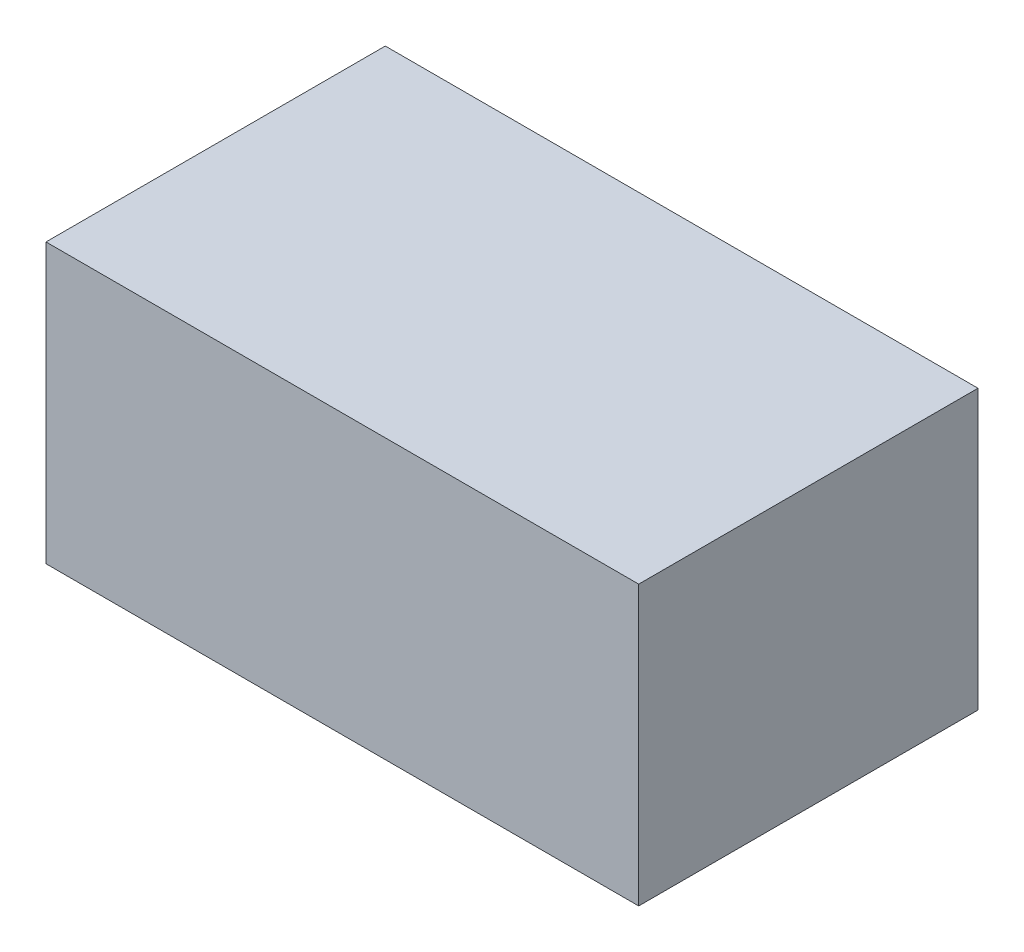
ISO-10303-21;
HEADER;
FILE_DESCRIPTION(('STEP AP214'),'2;1');
FILE_NAME('part.step','',(''),(''),'','','');
FILE_SCHEMA(('AUTOMOTIVE_DESIGN { 1 0 10303 214 1 1 1 1 }'));
ENDSEC;
DATA;
#1=APPLICATION_CONTEXT('core data for automotive mechanical design processes');
#2=APPLICATION_PROTOCOL_DEFINITION('international standard','automotive_design',2000,#1);
#3=PRODUCT_CONTEXT('',#1,'mechanical');
#4=PRODUCT('Part','Part','',(#3));
#5=PRODUCT_RELATED_PRODUCT_CATEGORY('part','',(#4));
#6=PRODUCT_DEFINITION_FORMATION('','',#4);
#7=PRODUCT_DEFINITION_CONTEXT('part definition',#1,'design');
#8=PRODUCT_DEFINITION('design','',#6,#7);
#9=PRODUCT_DEFINITION_SHAPE('','',#8);
#10=(LENGTH_UNIT() NAMED_UNIT(*) SI_UNIT(.MILLI.,.METRE.));
#11=(NAMED_UNIT(*) PLANE_ANGLE_UNIT() SI_UNIT($,.RADIAN.));
#12=(NAMED_UNIT(*) SI_UNIT($,.STERADIAN.) SOLID_ANGLE_UNIT());
#13=UNCERTAINTY_MEASURE_WITH_UNIT(LENGTH_MEASURE(1.E-05),#10,'distance_accuracy_value','');
#14=(GEOMETRIC_REPRESENTATION_CONTEXT(3) GLOBAL_UNCERTAINTY_ASSIGNED_CONTEXT((#13)) GLOBAL_UNIT_ASSIGNED_CONTEXT((#10,
#11,#12)) REPRESENTATION_CONTEXT('',''));
#15=CARTESIAN_POINT('',(0.,0.,0.));
#16=DIRECTION('',(0.,0.,1.));
#17=DIRECTION('',(1.,0.,0.));
#18=AXIS2_PLACEMENT_3D('',#15,#16,#17);
#19=CARTESIAN_POINT('',(0.,190.292516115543,0.));
#20=DIRECTION('',(0.,-1.,0.));
#21=DIRECTION('',(0.,0.,-1.));
#22=AXIS2_PLACEMENT_3D('',#19,#20,#21);
#23=PLANE('',#22);
#24=DIRECTION('',(0.,0.,1.));
#25=VECTOR('',#24,1.);
#26=CARTESIAN_POINT('',(-106.323036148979,190.292516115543,-60.867504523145));
#27=LINE('',#26,#25);
#28=CARTESIAN_POINT('',(-106.323036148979,190.292516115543,-60.867504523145));
#29=VERTEX_POINT('',#28);
#30=CARTESIAN_POINT('',(-106.323036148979,190.292516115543,60.867504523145));
#31=VERTEX_POINT('',#30);
#32=EDGE_CURVE('E487',#29,#31,#27,.T.);
#33=ORIENTED_EDGE('',*,*,#32,.T.);
#34=DIRECTION('',(1.,0.,0.));
#35=VECTOR('',#34,1.);
#36=CARTESIAN_POINT('',(106.323036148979,190.292516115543,60.867504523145));
#37=LINE('',#36,#35);
#38=CARTESIAN_POINT('',(106.323036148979,190.292516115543,60.867504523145));
#39=VERTEX_POINT('',#38);
#40=EDGE_CURVE('E467',#31,#39,#37,.T.);
#41=ORIENTED_EDGE('',*,*,#40,.T.);
#42=DIRECTION('',(0.,0.,-1.));
#43=VECTOR('',#42,1.);
#44=CARTESIAN_POINT('',(106.323036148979,190.292516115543,-60.867504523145));
#45=LINE('',#44,#43);
#46=CARTESIAN_POINT('',(106.323036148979,190.292516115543,-60.867504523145));
#47=VERTEX_POINT('',#46);
#48=EDGE_CURVE('E490',#39,#47,#45,.T.);
#49=ORIENTED_EDGE('',*,*,#48,.T.);
#50=DIRECTION('',(-1.,0.,0.));
#51=VECTOR('',#50,1.);
#52=CARTESIAN_POINT('',(106.323036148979,190.292516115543,-60.867504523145));
#53=LINE('',#52,#51);
#54=EDGE_CURVE('E493',#47,#29,#53,.T.);
#55=ORIENTED_EDGE('',*,*,#54,.T.);
#56=EDGE_LOOP('',(#33,#41,#49,#55));
#57=FACE_BOUND('',#56,.T.);
#58=ADVANCED_FACE('F40',(#57),#23,.F.);
#59=CARTESIAN_POINT('',(106.323036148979,190.292516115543,-60.867504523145));
#60=DIRECTION('',(0.,0.,1.));
#61=DIRECTION('',(1.,0.,0.));
#62=AXIS2_PLACEMENT_3D('',#59,#60,#61);
#63=PLANE('',#62);
#64=DIRECTION('',(0.,-1.,0.));
#65=VECTOR('',#64,1.);
#66=CARTESIAN_POINT('',(106.323036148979,190.292516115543,-60.867504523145));
#67=LINE('',#66,#65);
#68=CARTESIAN_POINT('',(106.323036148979,90.2925161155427,-60.867504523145));
#69=VERTEX_POINT('',#68);
#70=EDGE_CURVE('E497',#47,#69,#67,.T.);
#71=ORIENTED_EDGE('',*,*,#70,.T.);
#72=DIRECTION('',(-1.,0.,0.));
#73=VECTOR('',#72,1.);
#74=CARTESIAN_POINT('',(106.323036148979,90.2925161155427,-60.867504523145));
#75=LINE('',#74,#73);
#76=CARTESIAN_POINT('',(-106.323036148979,90.2925161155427,-60.867504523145));
#77=VERTEX_POINT('',#76);
#78=EDGE_CURVE('E44',#69,#77,#75,.T.);
#79=ORIENTED_EDGE('',*,*,#78,.T.);
#80=DIRECTION('',(0.,-1.,0.));
#81=VECTOR('',#80,1.);
#82=CARTESIAN_POINT('',(-106.323036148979,190.292516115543,-60.867504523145));
#83=LINE('',#82,#81);
#84=EDGE_CURVE('E478',#29,#77,#83,.T.);
#85=ORIENTED_EDGE('',*,*,#84,.F.);
#86=ORIENTED_EDGE('',*,*,#54,.F.);
#87=EDGE_LOOP('',(#71,#79,#85,#86));
#88=FACE_BOUND('',#87,.T.);
#89=ADVANCED_FACE('F439',(#88),#63,.F.);
#90=CARTESIAN_POINT('',(106.323036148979,190.292516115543,-60.867504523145));
#91=DIRECTION('',(-1.,0.,0.));
#92=DIRECTION('',(0.,0.,1.));
#93=AXIS2_PLACEMENT_3D('',#90,#91,#92);
#94=PLANE('',#93);
#95=DIRECTION('',(0.,-1.,0.));
#96=VECTOR('',#95,1.);
#97=CARTESIAN_POINT('',(106.323036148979,190.292516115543,60.867504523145));
#98=LINE('',#97,#96);
#99=CARTESIAN_POINT('',(106.323036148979,90.2925161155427,60.867504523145));
#100=VERTEX_POINT('',#99);
#101=EDGE_CURVE('E472',#39,#100,#98,.T.);
#102=ORIENTED_EDGE('',*,*,#101,.T.);
#103=DIRECTION('',(0.,0.,-1.));
#104=VECTOR('',#103,1.);
#105=CARTESIAN_POINT('',(106.323036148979,90.2925161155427,-60.867504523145));
#106=LINE('',#105,#104);
#107=EDGE_CURVE('E483',#100,#69,#106,.T.);
#108=ORIENTED_EDGE('',*,*,#107,.T.);
#109=ORIENTED_EDGE('',*,*,#70,.F.);
#110=ORIENTED_EDGE('',*,*,#48,.F.);
#111=EDGE_LOOP('',(#102,#108,#109,#110));
#112=FACE_BOUND('',#111,.T.);
#113=ADVANCED_FACE('F443',(#112),#94,.F.);
#114=CARTESIAN_POINT('',(106.323036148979,190.292516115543,60.867504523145));
#115=DIRECTION('',(0.,0.,-1.));
#116=DIRECTION('',(-1.,0.,0.));
#117=AXIS2_PLACEMENT_3D('',#114,#115,#116);
#118=PLANE('',#117);
#119=DIRECTION('',(0.,-1.,0.));
#120=VECTOR('',#119,1.);
#121=CARTESIAN_POINT('',(-106.323036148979,190.292516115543,60.867504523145));
#122=LINE('',#121,#120);
#123=CARTESIAN_POINT('',(-106.323036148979,90.2925161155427,60.867504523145));
#124=VERTEX_POINT('',#123);
#125=EDGE_CURVE('E459',#31,#124,#122,.T.);
#126=ORIENTED_EDGE('',*,*,#125,.T.);
#127=DIRECTION('',(1.,0.,0.));
#128=VECTOR('',#127,1.);
#129=CARTESIAN_POINT('',(106.323036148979,90.2925161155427,60.867504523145));
#130=LINE('',#129,#128);
#131=EDGE_CURVE('E464',#124,#100,#130,.T.);
#132=ORIENTED_EDGE('',*,*,#131,.T.);
#133=ORIENTED_EDGE('',*,*,#101,.F.);
#134=ORIENTED_EDGE('',*,*,#40,.F.);
#135=EDGE_LOOP('',(#126,#132,#133,#134));
#136=FACE_BOUND('',#135,.T.);
#137=ADVANCED_FACE('F446',(#136),#118,.F.);
#138=CARTESIAN_POINT('',(-106.323036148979,190.292516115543,-60.867504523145));
#139=DIRECTION('',(1.,0.,0.));
#140=DIRECTION('',(0.,0.,-1.));
#141=AXIS2_PLACEMENT_3D('',#138,#139,#140);
#142=PLANE('',#141);
#143=ORIENTED_EDGE('',*,*,#84,.T.);
#144=DIRECTION('',(0.,0.,1.));
#145=VECTOR('',#144,1.);
#146=CARTESIAN_POINT('',(-106.323036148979,90.2925161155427,-60.867504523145));
#147=LINE('',#146,#145);
#148=EDGE_CURVE('E475',#77,#124,#147,.T.);
#149=ORIENTED_EDGE('',*,*,#148,.T.);
#150=ORIENTED_EDGE('',*,*,#125,.F.);
#151=ORIENTED_EDGE('',*,*,#32,.F.);
#152=EDGE_LOOP('',(#143,#149,#150,#151));
#153=FACE_BOUND('',#152,.T.);
#154=ADVANCED_FACE('F42',(#153),#142,.F.);
#155=CARTESIAN_POINT('',(95.4365337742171,90.2925161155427,-50.4363433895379));
#156=DIRECTION('',(0.,1.,0.));
#157=DIRECTION('',(0.707106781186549,0.,0.707106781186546));
#158=AXIS2_PLACEMENT_3D('',#155,#156,#157);
#159=PLANE('',#158);
#160=CARTESIAN_POINT('',(95.4361529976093,90.2925161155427,-45.4361529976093));
#161=DIRECTION('',(0.,1.,0.));
#162=DIRECTION('',(0.707106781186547,0.,-0.707106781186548));
#163=AXIS2_PLACEMENT_3D('',#160,#161,#162);
#164=ELLIPSE('',#163,5.0003807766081,5.);
#165=CARTESIAN_POINT('',(95.4365337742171,90.2925161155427,-50.4363433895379));
#166=VERTEX_POINT('',#165);
#167=CARTESIAN_POINT('',(100.436343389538,90.2925161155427,-45.4365337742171));
#168=VERTEX_POINT('',#167);
#169=EDGE_CURVE('E401',#166,#168,#164,.F.);
#170=ORIENTED_EDGE('',*,*,#169,.F.);
#171=DIRECTION('',(1.,0.,0.));
#172=VECTOR('',#171,1.);
#173=CARTESIAN_POINT('',(100.,90.2925161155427,-50.4363433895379));
#174=LINE('',#173,#172);
#175=CARTESIAN_POINT('',(-95.,90.2925161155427,-50.4363433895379));
#176=VERTEX_POINT('',#175);
#177=EDGE_CURVE('E361',#166,#176,#174,.F.);
#178=ORIENTED_EDGE('',*,*,#177,.T.);
#179=CARTESIAN_POINT('',(-100.436343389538,90.2925161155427,-44.9998096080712));
#180=CARTESIAN_POINT('',(-100.436343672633,90.2925161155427,-45.1525705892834));
#181=CARTESIAN_POINT('',(-100.429825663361,90.2925161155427,-45.3053196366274));
#182=CARTESIAN_POINT('',(-100.403960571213,90.2925161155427,-45.6097377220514));
#183=CARTESIAN_POINT('',(-100.384612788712,90.2925161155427,-45.7614067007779));
#184=CARTESIAN_POINT('',(-100.333316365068,90.2925161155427,-46.0624703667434));
#185=CARTESIAN_POINT('',(-100.3013778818,90.2925161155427,-46.2118667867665));
#186=CARTESIAN_POINT('',(-100.225117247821,90.2925161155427,-46.5074589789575));
#187=CARTESIAN_POINT('',(-100.180795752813,90.2925161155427,-46.6536549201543));
#188=CARTESIAN_POINT('',(-100.079922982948,90.2925161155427,-46.9418699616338));
#189=CARTESIAN_POINT('',(-100.023364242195,90.2925161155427,-47.0838864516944));
#190=CARTESIAN_POINT('',(-99.8983800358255,90.2925161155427,-47.3626007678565));
#191=CARTESIAN_POINT('',(-99.8299541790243,90.2925161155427,-47.4992984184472));
#192=CARTESIAN_POINT('',(-99.681901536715,90.2925161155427,-47.7664461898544));
#193=CARTESIAN_POINT('',(-99.6022770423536,90.2925161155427,-47.896897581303));
#194=CARTESIAN_POINT('',(-99.4324004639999,90.2925161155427,-48.1506864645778));
#195=CARTESIAN_POINT('',(-99.3421483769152,90.2925161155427,-48.2740239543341));
#196=CARTESIAN_POINT('',(-99.1515307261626,90.2925161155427,-48.5128150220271));
#197=CARTESIAN_POINT('',(-99.0511557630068,90.2925161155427,-48.6282611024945));
#198=CARTESIAN_POINT('',(-98.8409513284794,90.2925161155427,-48.8501908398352));
#199=CARTESIAN_POINT('',(-98.7311221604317,90.2925161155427,-48.9566747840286));
#200=CARTESIAN_POINT('',(-98.5028226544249,90.2925161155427,-49.15998535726));
#201=CARTESIAN_POINT('',(-98.3843509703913,90.2925161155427,-49.2568104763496));
#202=CARTESIAN_POINT('',(-98.1397484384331,90.2925161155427,-49.4401829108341));
#203=CARTESIAN_POINT('',(-98.0136172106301,90.2925161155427,-49.5267297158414));
#204=CARTESIAN_POINT('',(-97.625224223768,90.2925161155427,-49.7699143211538));
#205=CARTESIAN_POINT('',(-97.3525865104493,90.2925161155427,-49.9104306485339));
#206=CARTESIAN_POINT('',(-96.7876447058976,90.2925161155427,-50.1430871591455));
#207=CARTESIAN_POINT('',(-96.4953518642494,90.2925161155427,-50.2352547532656));
#208=CARTESIAN_POINT('',(-96.0011062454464,90.2925161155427,-50.3468142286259));
#209=CARTESIAN_POINT('',(-95.802221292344,90.2925161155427,-50.380294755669));
#210=CARTESIAN_POINT('',(-95.4022589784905,90.2925161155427,-50.4250363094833));
#211=CARTESIAN_POINT('',(-95.201185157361,90.2925161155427,-50.4363290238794));
#212=CARTESIAN_POINT('',(-95.,90.2925161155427,-50.4363433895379));
#213=B_SPLINE_CURVE_WITH_KNOTS('',3,(#179,#180,#181,#182,#183,#184,#185,#186,#187,#188,#189,
#190,#191,#192,#193,#194,#195,#196,#197,#198,#199,#200,#201,#202,#203,#204,#205,#206,#207,#208,
#209,#210,#211,#212),.UNSPECIFIED.,.F.,.F.,(4,2,2,2,2,2,2,2,2,2,2,2,2,2,2,2,4),(0.,
0.45812798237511,0.916280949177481,1.37406504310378,1.83182490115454,2.28986482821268,
2.74791985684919,3.20588130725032,3.6638428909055,4.12223369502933,4.58060979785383,
5.0390574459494,5.49752784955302,6.41297642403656,7.32790543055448,7.93180589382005,
8.53484326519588),.UNSPECIFIED.);
#214=CARTESIAN_POINT('',(-100.436343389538,90.2925161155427,-44.9998096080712));
#215=VERTEX_POINT('',#214);
#216=EDGE_CURVE('E369',#215,#176,#213,.T.);
#217=ORIENTED_EDGE('',*,*,#216,.F.);
#218=DIRECTION('',(0.,0.,-1.));
#219=VECTOR('',#218,1.);
#220=CARTESIAN_POINT('',(-100.436343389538,90.2925161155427,50.));
#221=LINE('',#220,#219);
#222=CARTESIAN_POINT('',(-100.436343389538,90.2925161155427,44.9998096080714));
#223=VERTEX_POINT('',#222);
#224=EDGE_CURVE('E372',#215,#223,#221,.F.);
#225=ORIENTED_EDGE('',*,*,#224,.T.);
#226=CARTESIAN_POINT('',(-95.,90.2925161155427,50.436343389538));
#227=CARTESIAN_POINT('',(-95.1527475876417,90.2925161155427,50.4363436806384));
#228=CARTESIAN_POINT('',(-95.3054832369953,90.2925161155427,50.4298261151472));
#229=CARTESIAN_POINT('',(-95.6098745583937,90.2925161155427,50.4039628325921));
#230=CARTESIAN_POINT('',(-95.7615301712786,90.2925161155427,50.3846164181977));
#231=CARTESIAN_POINT('',(-96.0625669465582,90.2925161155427,50.3333237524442));
#232=CARTESIAN_POINT('',(-96.2119498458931,90.2925161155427,50.3013876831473));
#233=CARTESIAN_POINT('',(-96.5075152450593,90.2925161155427,50.2251329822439));
#234=CARTESIAN_POINT('',(-96.6536979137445,90.2925161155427,50.18081500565));
#235=CARTESIAN_POINT('',(-96.9418867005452,90.2925161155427,50.0799505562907));
#236=CARTESIAN_POINT('',(-97.0838902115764,90.2925161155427,50.0233966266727));
#237=CARTESIAN_POINT('',(-97.3625791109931,90.2925161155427,49.8984233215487));
#238=CARTESIAN_POINT('',(-97.4992643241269,90.2925161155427,49.8300035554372));
#239=CARTESIAN_POINT('',(-97.7663880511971,90.2925161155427,49.6819644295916));
#240=CARTESIAN_POINT('',(-97.8968278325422,90.2925161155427,49.6023473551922));
#241=CARTESIAN_POINT('',(-98.1505945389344,90.2925161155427,49.4324870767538));
#242=CARTESIAN_POINT('',(-98.27392146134,90.2925161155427,49.3422438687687));
#243=CARTESIAN_POINT('',(-98.5126965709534,90.2925161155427,49.151642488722));
#244=CARTESIAN_POINT('',(-98.6281370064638,90.2925161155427,49.0512745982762));
#245=CARTESIAN_POINT('',(-98.8500566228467,90.2925161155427,48.841085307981));
#246=CARTESIAN_POINT('',(-98.9565360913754,90.2925161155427,48.7312642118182));
#247=CARTESIAN_POINT('',(-99.1598390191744,90.2925161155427,48.5029816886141));
#248=CARTESIAN_POINT('',(-99.2566609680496,90.2925161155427,48.3845189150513));
#249=CARTESIAN_POINT('',(-99.4400287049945,90.2925161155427,48.1399350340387));
#250=CARTESIAN_POINT('',(-99.5265739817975,90.2925161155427,48.0138135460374));
#251=CARTESIAN_POINT('',(-99.7697677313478,90.2925161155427,47.6254339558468));
#252=CARTESIAN_POINT('',(-99.9102949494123,90.2925161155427,47.3527993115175));
#253=CARTESIAN_POINT('',(-100.142977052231,90.2925161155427,46.7878626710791));
#254=CARTESIAN_POINT('',(-100.235159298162,90.2925161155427,46.4955719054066));
#255=CARTESIAN_POINT('',(-100.34676164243,90.2925161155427,46.0012614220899));
#256=CARTESIAN_POINT('',(-100.380261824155,90.2925161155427,45.8023085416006));
#257=CARTESIAN_POINT('',(-100.425029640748,90.2925161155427,45.402208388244));
#258=CARTESIAN_POINT('',(-100.436328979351,90.2925161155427,45.2010646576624));
#259=CARTESIAN_POINT('',(-100.436343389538,90.2925161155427,44.9998096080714));
#260=B_SPLINE_CURVE_WITH_KNOTS('',3,(#226,#227,#228,#229,#230,#231,#232,#233,#234,#235,#236,
#237,#238,#239,#240,#241,#242,#243,#244,#245,#246,#247,#248,#249,#250,#251,#252,#253,#254,#255,
#256,#257,#258,#259),.UNSPECIFIED.,.F.,.F.,(4,2,2,2,2,2,2,2,2,2,2,2,2,2,2,2,4),(0.,
0.458087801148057,0.916200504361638,1.37394346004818,1.83166220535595,2.28966068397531,
2.74767424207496,3.20559445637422,3.66351484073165,4.12187902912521,4.58022849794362,
5.03864953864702,5.49709337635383,6.41254914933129,7.32748625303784,7.9315964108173,
8.53484324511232),.UNSPECIFIED.);
#261=CARTESIAN_POINT('',(-95.,90.2925161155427,50.436343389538));
#262=VERTEX_POINT('',#261);
#263=EDGE_CURVE('E376',#262,#223,#260,.T.);
#264=ORIENTED_EDGE('',*,*,#263,.F.);
#265=DIRECTION('',(-1.,0.,0.));
#266=VECTOR('',#265,1.);
#267=CARTESIAN_POINT('',(100.,90.2925161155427,50.436343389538));
#268=LINE('',#267,#266);
#269=CARTESIAN_POINT('',(95.4365337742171,90.2925161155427,50.436343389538));
#270=VERTEX_POINT('',#269);
#271=EDGE_CURVE('E384',#262,#270,#268,.F.);
#272=ORIENTED_EDGE('',*,*,#271,.T.);
#273=CARTESIAN_POINT('',(95.4361529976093,90.2925161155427,45.4361529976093));
#274=DIRECTION('',(0.,1.,0.));
#275=DIRECTION('',(0.707106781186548,0.,0.707106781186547));
#276=AXIS2_PLACEMENT_3D('',#273,#274,#275);
#277=ELLIPSE('',#276,5.0003807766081,5.);
#278=CARTESIAN_POINT('',(100.436343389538,90.2925161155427,45.4365337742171));
#279=VERTEX_POINT('',#278);
#280=EDGE_CURVE('E388',#279,#270,#277,.F.);
#281=ORIENTED_EDGE('',*,*,#280,.F.);
#282=DIRECTION('',(0.,0.,1.));
#283=VECTOR('',#282,1.);
#284=CARTESIAN_POINT('',(100.436343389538,90.2925161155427,50.));
#285=LINE('',#284,#283);
#286=EDGE_CURVE('E397',#279,#168,#285,.F.);
#287=ORIENTED_EDGE('',*,*,#286,.T.);
#288=EDGE_LOOP('',(#170,#178,#217,#225,#264,#272,#281,#287));
#289=FACE_BOUND('',#288,.T.);
#290=ORIENTED_EDGE('',*,*,#78,.F.);
#291=ORIENTED_EDGE('',*,*,#107,.F.);
#292=ORIENTED_EDGE('',*,*,#131,.F.);
#293=ORIENTED_EDGE('',*,*,#148,.F.);
#294=EDGE_LOOP('',(#290,#291,#292,#293));
#295=FACE_BOUND('',#294,.T.);
#296=ADVANCED_FACE('F430',(#289,#295),#159,.F.);
#297=CARTESIAN_POINT('',(100.,140.292516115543,-50.));
#298=DIRECTION('',(0.,0.00872653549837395,-0.999961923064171));
#299=DIRECTION('',(0.,0.999961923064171,0.00872653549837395));
#300=AXIS2_PLACEMENT_3D('',#297,#298,#299);
#301=PLANE('',#300);
#302=DIRECTION('',(-1.,0.,0.));
#303=VECTOR('',#302,1.);
#304=CARTESIAN_POINT('',(100.,140.292516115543,-50.));
#305=LINE('',#304,#303);
#306=CARTESIAN_POINT('',(95.0001903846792,140.292516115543,-50.));
#307=VERTEX_POINT('',#306);
#308=CARTESIAN_POINT('',(-95.,140.292516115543,-50.));
#309=VERTEX_POINT('',#308);
#310=EDGE_CURVE('E368',#307,#309,#305,.T.);
#311=ORIENTED_EDGE('',*,*,#310,.T.);
#312=CARTESIAN_POINT('',(-95.,80.2925161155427,-50.5236120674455));
#313=CARTESIAN_POINT('',(-95.,140.292516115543,-50.));
#314=B_SPLINE_CURVE_WITH_KNOTS('',1,(#312,#313),.UNSPECIFIED.,.F.,.F.,(2,2),(0.,1.),.UNSPECIFIED.);
#315=EDGE_CURVE('E354',#176,#309,#314,.T.);
#316=ORIENTED_EDGE('',*,*,#315,.F.);
#317=ORIENTED_EDGE('',*,*,#177,.F.);
#318=DIRECTION('',(-0.00872620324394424,0.999923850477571,0.00872620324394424));
#319=VECTOR('',#318,1.);
#320=CARTESIAN_POINT('',(95.0005711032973,140.248890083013,-50.0003807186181));
#321=LINE('',#320,#319);
#322=EDGE_CURVE('E360',#307,#166,#321,.F.);
#323=ORIENTED_EDGE('',*,*,#322,.F.);
#324=EDGE_LOOP('',(#311,#316,#317,#323));
#325=FACE_BOUND('',#324,.T.);
#326=ADVANCED_FACE('F434',(#325),#301,.F.);
#327=CARTESIAN_POINT('',(-95.,80.2925161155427,-50.5236120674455));
#328=CARTESIAN_POINT('',(-95.7231721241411,80.2925161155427,-50.5236120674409));
#329=CARTESIAN_POINT('',(-96.4457989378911,80.2925161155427,-50.3798411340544));
#330=CARTESIAN_POINT('',(-97.7818037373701,80.2925161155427,-49.8264287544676));
#331=CARTESIAN_POINT('',(-98.394525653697,80.2925161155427,-49.4170051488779));
#332=CARTESIAN_POINT('',(-99.4170555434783,80.2925161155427,-48.3944363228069));
#333=CARTESIAN_POINT('',(-99.8264612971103,80.2925161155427,-47.7816935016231));
#334=CARTESIAN_POINT('',(-100.379848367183,80.2925161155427,-46.4456480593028));
#335=CARTESIAN_POINT('',(-100.523612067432,80.2925161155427,-45.7230013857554));
#336=CARTESIAN_POINT('',(-100.523612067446,80.2925161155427,-44.9998096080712));
#337=CARTESIAN_POINT('',(-95.,140.292516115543,-50.));
#338=CARTESIAN_POINT('',(-95.6546164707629,140.292516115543,-49.9999999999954));
#339=CARTESIAN_POINT('',(-96.3087394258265,140.292516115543,-49.8698584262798));
#340=CARTESIAN_POINT('',(-97.5180948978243,140.292516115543,-49.3689079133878));
#341=CARTESIAN_POINT('',(-98.0727336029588,140.292516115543,-48.9982960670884));
#342=CARTESIAN_POINT('',(-98.9983342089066,140.292516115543,-48.0726602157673));
#343=CARTESIAN_POINT('',(-99.3689319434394,140.292516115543,-47.5180003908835));
#344=CARTESIAN_POINT('',(-99.8698633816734,140.292516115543,-46.3085988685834));
#345=CARTESIAN_POINT('',(-99.9999999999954,140.292516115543,-45.6544510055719));
#346=CARTESIAN_POINT('',(-100.,140.292516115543,-44.9998096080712));
#347=B_SPLINE_SURFACE_WITH_KNOTS('',1,3,((#327,#328,#329,#330,#331,#332,#333,#334,#335,#336),
(#337,#338,#339,#340,#341,#342,#343,#344,#345,#346)),.UNSPECIFIED.,.F.,.F.,.F.,(2,2),(4,2,2,2,
4),(0.,1.),(3.14159265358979,3.53429173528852,3.92699081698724,4.31968989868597,
4.7123889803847),.UNSPECIFIED.);
#348=CARTESIAN_POINT('',(-95.,140.292516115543,-50.));
#349=CARTESIAN_POINT('',(-95.1405120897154,140.292516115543,-50.0000002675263));
#350=CARTESIAN_POINT('',(-95.2810131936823,140.292516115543,-49.9940037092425));
#351=CARTESIAN_POINT('',(-95.5610215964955,140.292516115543,-49.9702079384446));
#352=CARTESIAN_POINT('',(-95.7005288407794,140.292516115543,-49.9524080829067));
#353=CARTESIAN_POINT('',(-95.9774503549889,140.292516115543,-49.9052158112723));
#354=CARTESIAN_POINT('',(-96.1148662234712,140.292516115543,-49.8758327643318));
#355=CARTESIAN_POINT('',(-96.3867528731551,140.292516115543,-49.8056740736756));
#356=CARTESIAN_POINT('',(-96.5212238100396,140.292516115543,-49.76489903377));
#357=CARTESIAN_POINT('',(-96.7863222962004,140.292516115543,-49.6720980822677));
#358=CARTESIAN_POINT('',(-96.9169474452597,140.292516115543,-49.6200653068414));
#359=CARTESIAN_POINT('',(-97.1733039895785,140.292516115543,-49.5050833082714));
#360=CARTESIAN_POINT('',(-97.2990352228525,140.292516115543,-49.4421337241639));
#361=CARTESIAN_POINT('',(-97.5447493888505,140.292516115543,-49.3059309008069));
#362=CARTESIAN_POINT('',(-97.6647334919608,140.292516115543,-49.2326797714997));
#363=CARTESIAN_POINT('',(-97.8981564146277,140.292516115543,-49.076401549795));
#364=CARTESIAN_POINT('',(-98.0115952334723,140.292516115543,-48.993374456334));
#365=CARTESIAN_POINT('',(-98.2312036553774,140.292516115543,-48.818029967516));
#366=CARTESIAN_POINT('',(-98.3373674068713,140.292516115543,-48.7257052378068));
#367=CARTESIAN_POINT('',(-98.5414517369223,140.292516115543,-48.5323618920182));
#368=CARTESIAN_POINT('',(-98.6393725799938,140.292516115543,-48.4313435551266));
#369=CARTESIAN_POINT('',(-98.826332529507,140.292516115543,-48.221361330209));
#370=CARTESIAN_POINT('',(-98.915370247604,140.292516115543,-48.1123962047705));
#371=CARTESIAN_POINT('',(-99.0839935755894,140.292516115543,-47.8874234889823));
#372=CARTESIAN_POINT('',(-99.1635787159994,140.292516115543,-47.7714155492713));
#373=CARTESIAN_POINT('',(-99.3872109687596,140.292516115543,-47.4141814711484));
#374=CARTESIAN_POINT('',(-99.51642939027,140.292516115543,-47.1634132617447));
#375=CARTESIAN_POINT('',(-99.7303741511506,140.292516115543,-46.6437934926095));
#376=CARTESIAN_POINT('',(-99.8151256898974,140.292516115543,-46.3749522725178));
#377=CARTESIAN_POINT('',(-99.9176953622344,140.292516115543,-45.9203996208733));
#378=CARTESIAN_POINT('',(-99.9484742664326,140.292516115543,-45.7375095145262));
#379=CARTESIAN_POINT('',(-99.989605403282,140.292516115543,-45.3697147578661));
#380=CARTESIAN_POINT('',(-99.9999867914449,140.292516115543,-45.1848133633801));
#381=CARTESIAN_POINT('',(-100.,140.292516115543,-44.9998096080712));
#382=B_SPLINE_CURVE_WITH_KNOTS('',3,(#348,#349,#350,#351,#352,#353,#354,#355,#356,#357,#358,
#359,#360,#361,#362,#363,#364,#365,#366,#367,#368,#369,#370,#371,#372,#373,#374,#375,#376,#377,
#378,#379,#380,#381),.UNSPECIFIED.,.F.,.F.,(4,2,2,2,2,2,2,2,2,2,2,2,2,2,2,2,4),(0.,
0.421393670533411,0.842810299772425,1.26388675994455,1.68494090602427,2.10625249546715,
2.52757801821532,2.94881737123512,3.37005677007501,3.79163110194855,4.2131919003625,
4.63481848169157,5.05646599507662,5.89844654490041,6.73994942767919,7.29527880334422,
7.84981383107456),.UNSPECIFIED.);
#383=CARTESIAN_POINT('',(-100.,140.292516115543,-44.9998096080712));
#384=VERTEX_POINT('',#383);
#385=EDGE_CURVE('E359',#309,#384,#382,.T.);
#386=DIRECTION('',(-0.00872653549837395,-0.999961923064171,0.));
#387=VECTOR('',#386,1.);
#388=CARTESIAN_POINT('',(-100.,140.292516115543,-44.9998096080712));
#389=LINE('',#388,#387);
#390=EDGE_CURVE('E377',#384,#215,#389,.T.);
#391=ORIENTED_EDGE('',*,*,#385,.T.);
#392=ORIENTED_EDGE('',*,*,#390,.T.);
#393=ORIENTED_EDGE('',*,*,#216,.T.);
#394=ORIENTED_EDGE('',*,*,#315,.T.);
#395=EDGE_LOOP('',(#391,#392,#393,#394));
#396=FACE_BOUND('',#395,.T.);
#397=ADVANCED_FACE('F424',(#396),#347,.T.);
#398=CARTESIAN_POINT('',(-100.,140.292516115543,50.));
#399=DIRECTION('',(-0.999961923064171,0.00872653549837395,0.));
#400=DIRECTION('',(-0.00872653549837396,-0.999961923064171,0.));
#401=AXIS2_PLACEMENT_3D('',#398,#399,#400);
#402=PLANE('',#401);
#403=ORIENTED_EDGE('',*,*,#224,.F.);
#404=ORIENTED_EDGE('',*,*,#390,.F.);
#405=DIRECTION('',(0.,0.,1.));
#406=VECTOR('',#405,1.);
#407=CARTESIAN_POINT('',(-100.,140.292516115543,50.));
#408=LINE('',#407,#406);
#409=CARTESIAN_POINT('',(-100.,140.292516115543,44.9998096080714));
#410=VERTEX_POINT('',#409);
#411=EDGE_CURVE('E383',#384,#410,#408,.T.);
#412=ORIENTED_EDGE('',*,*,#411,.T.);
#413=DIRECTION('',(-0.00872653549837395,-0.999961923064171,0.));
#414=VECTOR('',#413,1.);
#415=CARTESIAN_POINT('',(-100.,140.292516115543,44.9998096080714));
#416=LINE('',#415,#414);
#417=EDGE_CURVE('E380',#223,#410,#416,.F.);
#418=ORIENTED_EDGE('',*,*,#417,.F.);
#419=EDGE_LOOP('',(#403,#404,#412,#418));
#420=FACE_BOUND('',#419,.T.);
#421=ADVANCED_FACE('F728',(#420),#402,.F.);
#422=CARTESIAN_POINT('',(-100.523612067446,80.2925161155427,44.9998096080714));
#423=CARTESIAN_POINT('',(-100.523612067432,80.2925161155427,45.723001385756));
#424=CARTESIAN_POINT('',(-100.379848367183,80.2925161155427,46.4456480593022));
#425=CARTESIAN_POINT('',(-99.82646129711,80.2925161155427,47.781693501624));
#426=CARTESIAN_POINT('',(-99.4170555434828,80.2925161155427,48.3944363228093));
#427=CARTESIAN_POINT('',(-98.3945256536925,80.2925161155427,49.4170051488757));
#428=CARTESIAN_POINT('',(-97.7818037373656,80.2925161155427,49.8264287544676));
#429=CARTESIAN_POINT('',(-96.4457989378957,80.2925161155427,50.3798411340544));
#430=CARTESIAN_POINT('',(-95.7231721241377,80.2925161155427,50.523612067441));
#431=CARTESIAN_POINT('',(-95.,80.2925161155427,50.5236120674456));
#432=CARTESIAN_POINT('',(-100.,140.292516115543,44.9998096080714));
#433=CARTESIAN_POINT('',(-99.9999999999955,140.292516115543,45.6544510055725));
#434=CARTESIAN_POINT('',(-99.8698633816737,140.292516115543,46.3085988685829));
#435=CARTESIAN_POINT('',(-99.3689319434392,140.292516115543,47.5180003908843));
#436=CARTESIAN_POINT('',(-98.9983342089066,140.292516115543,48.0726602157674));
#437=CARTESIAN_POINT('',(-98.0727336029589,140.292516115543,48.9982960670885));
#438=CARTESIAN_POINT('',(-97.5180948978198,140.292516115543,49.3689079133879));
#439=CARTESIAN_POINT('',(-96.3087394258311,140.292516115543,49.8698584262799));
#440=CARTESIAN_POINT('',(-95.6546164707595,140.292516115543,49.9999999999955));
#441=CARTESIAN_POINT('',(-95.,140.292516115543,50.));
#442=B_SPLINE_SURFACE_WITH_KNOTS('',1,3,((#422,#423,#424,#425,#426,#427,#428,#429,#430,#431),
(#432,#433,#434,#435,#436,#437,#438,#439,#440,#441)),.UNSPECIFIED.,.F.,.F.,.F.,(2,2),(4,2,2,2,
4),(0.,1.),(1.5707963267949,1.96349540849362,2.35619449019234,2.74889357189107,
3.14159265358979),.UNSPECIFIED.);
#443=CARTESIAN_POINT('',(-100.,140.292516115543,44.9998096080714));
#444=CARTESIAN_POINT('',(-100.000000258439,140.292516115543,45.1403349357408));
#445=CARTESIAN_POINT('',(-99.9940032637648,140.292516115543,45.2808492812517));
#446=CARTESIAN_POINT('',(-99.9702057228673,140.292516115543,45.560884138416));
#447=CARTESIAN_POINT('',(-99.9524045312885,140.292516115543,45.7004045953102));
#448=CARTESIAN_POINT('',(-99.9052085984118,140.292516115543,45.9773527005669));
#449=CARTESIAN_POINT('',(-99.8758232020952,140.292516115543,46.1147819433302));
#450=CARTESIAN_POINT('',(-99.8056587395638,140.292516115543,46.3866951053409));
#451=CARTESIAN_POINT('',(-99.7648802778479,140.292516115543,46.5211791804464));
#452=CARTESIAN_POINT('',(-99.6720712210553,140.292516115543,46.7863036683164));
#453=CARTESIAN_POINT('',(-99.6200337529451,140.292516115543,46.9169416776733));
#454=CARTESIAN_POINT('',(-99.5050411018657,140.292516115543,47.1733234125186));
#455=CARTESIAN_POINT('',(-99.4420855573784,140.292516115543,47.2990669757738));
#456=CARTESIAN_POINT('',(-99.3058694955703,140.292516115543,47.5448049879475));
#457=CARTESIAN_POINT('',(-99.2326110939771,140.292516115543,47.6648006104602));
#458=CARTESIAN_POINT('',(-99.0763168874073,140.292516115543,47.8982455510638));
#459=CARTESIAN_POINT('',(-98.993281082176,140.292516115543,48.0116948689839));
#460=CARTESIAN_POINT('',(-98.817920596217,140.292516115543,48.2313192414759));
#461=CARTESIAN_POINT('',(-98.7255888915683,140.292516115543,48.3374886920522));
#462=CARTESIAN_POINT('',(-98.5322305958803,140.292516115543,48.5415832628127));
#463=CARTESIAN_POINT('',(-98.4312042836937,140.292516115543,48.6395086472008));
#464=CARTESIAN_POINT('',(-98.2212052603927,140.292516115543,48.8264763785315));
#465=CARTESIAN_POINT('',(-98.112231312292,140.292516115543,48.915517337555));
#466=CARTESIAN_POINT('',(-97.8872401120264,140.292516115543,49.0841455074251));
#467=CARTESIAN_POINT('',(-97.7712225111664,140.292516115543,49.1637322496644));
#468=CARTESIAN_POINT('',(-97.4139752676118,140.292516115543,49.3873555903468));
#469=CARTESIAN_POINT('',(-97.1632041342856,140.292516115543,49.5165632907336));
#470=CARTESIAN_POINT('',(-96.6435794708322,140.292516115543,49.7304828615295));
#471=CARTESIAN_POINT('',(-96.3747362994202,140.292516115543,49.8152199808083));
#472=CARTESIAN_POINT('',(-95.9202479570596,140.292516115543,49.9177473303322));
#473=CARTESIAN_POINT('',(-95.737425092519,140.292516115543,49.9485068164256));
#474=CARTESIAN_POINT('',(-95.3697667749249,140.292516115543,49.9896120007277));
#475=CARTESIAN_POINT('',(-95.1849345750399,140.292516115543,49.9999868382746));
#476=CARTESIAN_POINT('',(-95.,140.292516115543,50.));
#477=B_SPLINE_CURVE_WITH_KNOTS('',3,(#443,#444,#445,#446,#447,#448,#449,#450,#451,#452,#453,
#454,#455,#456,#457,#458,#459,#460,#461,#462,#463,#464,#465,#466,#467,#468,#469,#470,#471,#472,
#473,#474,#475,#476),.UNSPECIFIED.,.F.,.F.,(4,2,2,2,2,2,2,2,2,2,2,2,2,2,2,2,4),(0.,
0.421433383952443,0.842889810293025,1.2640069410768,1.68510173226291,2.10645430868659,
2.52782083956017,2.94910096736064,3.37038110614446,3.79198198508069,4.21356934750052,
4.63522246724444,5.05689647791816,5.8988696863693,6.7403643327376,7.2954861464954,
7.84981384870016),.UNSPECIFIED.);
#478=CARTESIAN_POINT('',(-95.,140.292516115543,50.));
#479=VERTEX_POINT('',#478);
#480=EDGE_CURVE('E393',#410,#479,#477,.T.);
#481=DIRECTION('',(0.,-0.999961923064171,0.00872653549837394));
#482=VECTOR('',#481,1.);
#483=CARTESIAN_POINT('',(-95.,110.292516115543,50.2618060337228));
#484=LINE('',#483,#482);
#485=EDGE_CURVE('E389',#479,#262,#484,.T.);
#486=ORIENTED_EDGE('',*,*,#480,.T.);
#487=ORIENTED_EDGE('',*,*,#485,.T.);
#488=ORIENTED_EDGE('',*,*,#263,.T.);
#489=ORIENTED_EDGE('',*,*,#417,.T.);
#490=EDGE_LOOP('',(#486,#487,#488,#489));
#491=FACE_BOUND('',#490,.T.);
#492=ADVANCED_FACE('F722',(#491),#442,.T.);
#493=CARTESIAN_POINT('',(100.,140.292516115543,50.));
#494=DIRECTION('',(0.,0.00872653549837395,0.999961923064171));
#495=DIRECTION('',(0.,-0.999961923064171,0.00872653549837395));
#496=AXIS2_PLACEMENT_3D('',#493,#494,#495);
#497=PLANE('',#496);
#498=ORIENTED_EDGE('',*,*,#271,.F.);
#499=ORIENTED_EDGE('',*,*,#485,.F.);
#500=DIRECTION('',(1.,0.,0.));
#501=VECTOR('',#500,1.);
#502=CARTESIAN_POINT('',(100.,140.292516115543,50.));
#503=LINE('',#502,#501);
#504=CARTESIAN_POINT('',(95.0001903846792,140.292516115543,50.));
#505=VERTEX_POINT('',#504);
#506=EDGE_CURVE('E396',#479,#505,#503,.T.);
#507=ORIENTED_EDGE('',*,*,#506,.T.);
#508=DIRECTION('',(-0.00872620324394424,0.999923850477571,-0.00872620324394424));
#509=VECTOR('',#508,1.);
#510=CARTESIAN_POINT('',(95.0005711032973,140.248890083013,50.0003807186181));
#511=LINE('',#510,#509);
#512=EDGE_CURVE('E392',#270,#505,#511,.T.);
#513=ORIENTED_EDGE('',*,*,#512,.F.);
#514=EDGE_LOOP('',(#498,#499,#507,#513));
#515=FACE_BOUND('',#514,.T.);
#516=ADVANCED_FACE('F719',(#515),#497,.F.);
#517=CARTESIAN_POINT('',(95.0005711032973,140.205257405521,45.0005711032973));
#518=DIRECTION('',(0.00872620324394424,-0.99992385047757,0.00872620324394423));
#519=DIRECTION('',(0.999961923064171,0.00872653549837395,0.));
#520=AXIS2_PLACEMENT_3D('',#517,#518,#519);
#521=CYLINDRICAL_SURFACE('',#520,5.);
#522=CARTESIAN_POINT('',(94.9998096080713,140.292516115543,44.9998096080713));
#523=DIRECTION('',(0.,1.,0.));
#524=DIRECTION('',(0.707106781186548,0.,0.707106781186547));
#525=AXIS2_PLACEMENT_3D('',#522,#523,#524);
#526=ELLIPSE('',#525,5.0003807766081,5.);
#527=CARTESIAN_POINT('',(100.,140.292516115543,45.0001903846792));
#528=VERTEX_POINT('',#527);
#529=EDGE_CURVE('E406',#505,#528,#526,.T.);
#530=ORIENTED_EDGE('',*,*,#529,.T.);
#531=DIRECTION('',(-0.00872620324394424,0.999923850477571,-0.00872620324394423));
#532=VECTOR('',#531,1.);
#533=CARTESIAN_POINT('',(100.000380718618,140.248890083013,45.0005711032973));
#534=LINE('',#533,#532);
#535=EDGE_CURVE('E402',#528,#279,#534,.F.);
#536=ORIENTED_EDGE('',*,*,#535,.T.);
#537=ORIENTED_EDGE('',*,*,#280,.T.);
#538=ORIENTED_EDGE('',*,*,#512,.T.);
#539=EDGE_LOOP('',(#530,#536,#537,#538));
#540=FACE_BOUND('',#539,.T.);
#541=ADVANCED_FACE('F715',(#540),#521,.F.);
#542=CARTESIAN_POINT('',(100.,140.292516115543,50.));
#543=DIRECTION('',(0.999961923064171,0.00872653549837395,0.));
#544=DIRECTION('',(-0.00872653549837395,0.999961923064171,0.));
#545=AXIS2_PLACEMENT_3D('',#542,#543,#544);
#546=PLANE('',#545);
#547=ORIENTED_EDGE('',*,*,#286,.F.);
#548=ORIENTED_EDGE('',*,*,#535,.F.);
#549=DIRECTION('',(0.,0.,-1.));
#550=VECTOR('',#549,1.);
#551=CARTESIAN_POINT('',(100.,140.292516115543,50.));
#552=LINE('',#551,#550);
#553=CARTESIAN_POINT('',(100.,140.292516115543,-45.0001903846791));
#554=VERTEX_POINT('',#553);
#555=EDGE_CURVE('E337',#528,#554,#552,.T.);
#556=ORIENTED_EDGE('',*,*,#555,.T.);
#557=DIRECTION('',(-0.00872620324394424,0.999923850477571,0.00872620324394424));
#558=VECTOR('',#557,1.);
#559=CARTESIAN_POINT('',(99.9927660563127,141.121443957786,-44.9929564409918));
#560=LINE('',#559,#558);
#561=EDGE_CURVE('E405',#168,#554,#560,.T.);
#562=ORIENTED_EDGE('',*,*,#561,.F.);
#563=EDGE_LOOP('',(#547,#548,#556,#562));
#564=FACE_BOUND('',#563,.T.);
#565=ADVANCED_FACE('F711',(#564),#546,.F.);
#566=CARTESIAN_POINT('',(100.,140.292516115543,45.));
#567=DIRECTION('',(0.,0.00872653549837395,-0.999961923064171));
#568=DIRECTION('',(0.,0.999961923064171,0.00872653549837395));
#569=AXIS2_PLACEMENT_3D('',#566,#567,#568);
#570=PLANE('',#569);
#571=DIRECTION('',(0.00872620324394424,0.99992385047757,0.00872620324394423));
#572=VECTOR('',#571,1.);
#573=CARTESIAN_POINT('',(-94.1997931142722,141.987142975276,45.0147887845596));
#574=LINE('',#573,#572);
#575=CARTESIAN_POINT('',(-94.6072909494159,95.2925161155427,44.6072909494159));
#576=VERTEX_POINT('',#575);
#577=CARTESIAN_POINT('',(-94.4109364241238,117.792516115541,44.8036454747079));
#578=VERTEX_POINT('',#577);
#579=EDGE_CURVE('E333',#576,#578,#574,.T.);
#580=ORIENTED_EDGE('',*,*,#579,.T.);
#581=DIRECTION('',(-1.,0.,0.));
#582=VECTOR('',#581,1.);
#583=CARTESIAN_POINT('',(-94.6072909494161,117.792516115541,44.8036454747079));
#584=LINE('',#583,#582);
#585=CARTESIAN_POINT('',(-79.8036454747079,117.792516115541,44.8036454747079));
#586=VERTEX_POINT('',#585);
#587=EDGE_CURVE('E342',#586,#578,#584,.T.);
#588=ORIENTED_EDGE('',*,*,#587,.F.);
#589=DIRECTION('',(0.00872620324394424,-0.99992385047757,-0.00872620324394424));
#590=VECTOR('',#589,1.);
#591=CARTESIAN_POINT('',(-79.9862936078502,138.72191914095,44.9862936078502));
#592=LINE('',#591,#590);
#593=CARTESIAN_POINT('',(-79.6072909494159,95.2925161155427,44.6072909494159));
#594=VERTEX_POINT('',#593);
#595=EDGE_CURVE('E283',#586,#594,#592,.T.);
#596=ORIENTED_EDGE('',*,*,#595,.T.);
#597=DIRECTION('',(1.,0.,0.));
#598=VECTOR('',#597,1.);
#599=CARTESIAN_POINT('',(100.,95.2925161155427,44.6072909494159));
#600=LINE('',#599,#598);
#601=CARTESIAN_POINT('',(79.6072909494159,95.2925161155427,44.6072909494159));
#602=VERTEX_POINT('',#601);
#603=EDGE_CURVE('E257',#594,#602,#600,.T.);
#604=ORIENTED_EDGE('',*,*,#603,.T.);
#605=DIRECTION('',(-0.00872620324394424,-0.99992385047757,-0.00872620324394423));
#606=VECTOR('',#605,1.);
#607=CARTESIAN_POINT('',(79.6073208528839,95.2959427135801,44.6073208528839));
#608=LINE('',#607,#606);
#609=CARTESIAN_POINT('',(79.8036454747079,117.792516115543,44.8036454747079));
#610=VERTEX_POINT('',#609);
#611=EDGE_CURVE('E249',#602,#610,#608,.F.);
#612=ORIENTED_EDGE('',*,*,#611,.T.);
#613=DIRECTION('',(-1.,0.,0.));
#614=VECTOR('',#613,1.);
#615=CARTESIAN_POINT('',(94.6072909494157,117.792516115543,44.8036454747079));
#616=LINE('',#615,#614);
#617=CARTESIAN_POINT('',(94.4109364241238,117.792516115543,44.8036454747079));
#618=VERTEX_POINT('',#617);
#619=EDGE_CURVE('E246',#610,#618,#616,.F.);
#620=ORIENTED_EDGE('',*,*,#619,.T.);
#621=DIRECTION('',(-0.00872620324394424,0.99992385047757,0.00872620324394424));
#622=VECTOR('',#621,1.);
#623=CARTESIAN_POINT('',(94.6072610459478,95.2959427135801,44.6073208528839));
#624=LINE('',#623,#622);
#625=CARTESIAN_POINT('',(94.6072909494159,95.2925161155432,44.6072909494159));
#626=VERTEX_POINT('',#625);
#627=EDGE_CURVE('E250',#618,#626,#624,.F.);
#628=ORIENTED_EDGE('',*,*,#627,.T.);
#629=DIRECTION('',(-0.00872620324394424,-0.99992385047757,-0.00872620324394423));
#630=VECTOR('',#629,1.);
#631=CARTESIAN_POINT('',(95.0003807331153,140.336143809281,45.0003807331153));
#632=LINE('',#631,#630);
#633=CARTESIAN_POINT('',(95.,140.292516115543,45.));
#634=VERTEX_POINT('',#633);
#635=EDGE_CURVE('E609',#634,#626,#632,.T.);
#636=ORIENTED_EDGE('',*,*,#635,.F.);
#637=DIRECTION('',(1.,0.,0.));
#638=VECTOR('',#637,1.);
#639=CARTESIAN_POINT('',(100.,140.292516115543,45.));
#640=LINE('',#639,#638);
#641=CARTESIAN_POINT('',(-95.,140.292516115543,45.));
#642=VERTEX_POINT('',#641);
#643=EDGE_CURVE('E611',#642,#634,#640,.T.);
#644=ORIENTED_EDGE('',*,*,#643,.F.);
#645=DIRECTION('',(0.00872620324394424,-0.99992385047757,-0.00872620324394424));
#646=VECTOR('',#645,1.);
#647=CARTESIAN_POINT('',(-94.9851514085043,138.591036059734,44.9851514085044));
#648=LINE('',#647,#646);
#649=EDGE_CURVE('E336',#642,#576,#648,.T.);
#650=ORIENTED_EDGE('',*,*,#649,.T.);
#651=EDGE_LOOP('',(#580,#588,#596,#604,#612,#620,#628,#636,#644,#650));
#652=FACE_BOUND('',#651,.T.);
#653=ADVANCED_FACE('F707',(#652),#570,.F.);
#654=CARTESIAN_POINT('',(-88.,125.292516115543,38.3927090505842));
#655=DIRECTION('',(0.,1.,0.));
#656=DIRECTION('',(0.,0.,1.));
#657=AXIS2_PLACEMENT_3D('',#654,#655,#656);
#658=PLANE('',#657);
#659=CARTESIAN_POINT('',(-88.,125.292516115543,38.3927090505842));
#660=DIRECTION('',(0.,1.,0.));
#661=DIRECTION('',(0.,0.,1.));
#662=AXIS2_PLACEMENT_3D('',#659,#660,#661);
#663=CIRCLE('',#662,4.86909698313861);
#664=CARTESIAN_POINT('',(-88.,125.292516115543,43.2618060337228));
#665=VERTEX_POINT('',#664);
#666=EDGE_CURVE('E345',#665,#665,#663,.F.);
#667=ORIENTED_EDGE('',*,*,#666,.T.);
#668=EDGE_LOOP('',(#667));
#669=FACE_BOUND('',#668,.T.);
#670=ADVANCED_FACE('F703',(#669),#658,.F.);
#671=CARTESIAN_POINT('',(-88.,140.292516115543,38.3927090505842));
#672=DIRECTION('',(0.,1.,0.));
#673=DIRECTION('',(0.,0.,1.));
#674=AXIS2_PLACEMENT_3D('',#671,#672,#673);
#675=CONICAL_SURFACE('',#674,4.99999999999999,0.00872664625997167);
#676=ORIENTED_EDGE('',*,*,#666,.F.);
#677=EDGE_LOOP('',(#676));
#678=FACE_BOUND('',#677,.T.);
#679=CARTESIAN_POINT('',(-88.,140.292516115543,38.3927090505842));
#680=DIRECTION('',(0.,-1.,0.));
#681=DIRECTION('',(0.,0.,1.));
#682=AXIS2_PLACEMENT_3D('',#679,#680,#681);
#683=CIRCLE('',#682,4.99999999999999);
#684=CARTESIAN_POINT('',(-88.,140.292516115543,43.3927090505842));
#685=VERTEX_POINT('',#684);
#686=EDGE_CURVE('E332',#685,#685,#683,.T.);
#687=ORIENTED_EDGE('',*,*,#686,.T.);
#688=EDGE_LOOP('',(#687));
#689=FACE_BOUND('',#688,.T.);
#690=ADVANCED_FACE('F699',(#678,#689),#675,.T.);
#691=CARTESIAN_POINT('',(0.,140.292516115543,0.));
#692=DIRECTION('',(0.,1.,0.));
#693=DIRECTION('',(0.,0.,1.));
#694=AXIS2_PLACEMENT_3D('',#691,#692,#693);
#695=PLANE('',#694);
#696=ORIENTED_EDGE('',*,*,#686,.F.);
#697=EDGE_LOOP('',(#696));
#698=FACE_BOUND('',#697,.T.);
#699=DIRECTION('',(0.,0.,-1.));
#700=VECTOR('',#699,1.);
#701=CARTESIAN_POINT('',(-94.2145818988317,140.292516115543,45.));
#702=LINE('',#701,#700);
#703=CARTESIAN_POINT('',(-94.2145818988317,140.292516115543,44.6072909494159));
#704=VERTEX_POINT('',#703);
#705=CARTESIAN_POINT('',(-94.2145818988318,140.292516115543,30.3927090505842));
#706=VERTEX_POINT('',#705);
#707=EDGE_CURVE('E328',#704,#706,#702,.T.);
#708=ORIENTED_EDGE('',*,*,#707,.T.);
#709=DIRECTION('',(1.,0.,0.));
#710=VECTOR('',#709,1.);
#711=CARTESIAN_POINT('',(-94.6072909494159,140.292516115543,30.3927090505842));
#712=LINE('',#711,#710);
#713=CARTESIAN_POINT('',(-80.,140.292516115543,30.3927090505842));
#714=VERTEX_POINT('',#713);
#715=EDGE_CURVE('E319',#706,#714,#712,.T.);
#716=ORIENTED_EDGE('',*,*,#715,.T.);
#717=DIRECTION('',(0.,0.,1.));
#718=VECTOR('',#717,1.);
#719=CARTESIAN_POINT('',(-80.,140.292516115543,45.));
#720=LINE('',#719,#718);
#721=CARTESIAN_POINT('',(-80.,140.292516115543,44.6072909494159));
#722=VERTEX_POINT('',#721);
#723=EDGE_CURVE('E323',#714,#722,#720,.T.);
#724=ORIENTED_EDGE('',*,*,#723,.T.);
#725=DIRECTION('',(-1.,0.,0.));
#726=VECTOR('',#725,1.);
#727=CARTESIAN_POINT('',(-94.6072909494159,140.292516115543,44.6072909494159));
#728=LINE('',#727,#726);
#729=EDGE_CURVE('E331',#722,#704,#728,.T.);
#730=ORIENTED_EDGE('',*,*,#729,.T.);
#731=EDGE_LOOP('',(#708,#716,#724,#730));
#732=FACE_BOUND('',#731,.T.);
#733=ADVANCED_FACE('F695',(#698,#732),#695,.F.);
#734=CARTESIAN_POINT('',(-79.6072909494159,95.2925161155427,45.));
#735=DIRECTION('',(0.999961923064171,0.00872653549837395,0.));
#736=DIRECTION('',(-0.00872653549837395,0.999961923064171,0.));
#737=AXIS2_PLACEMENT_3D('',#734,#735,#736);
#738=PLANE('',#737);
#739=DIRECTION('',(0.00872620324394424,-0.99992385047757,-0.00872620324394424));
#740=VECTOR('',#739,1.);
#741=CARTESIAN_POINT('',(-79.6084331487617,95.4233991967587,30.0011421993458));
#742=LINE('',#741,#740);
#743=CARTESIAN_POINT('',(-79.6072909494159,95.2925161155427,30.));
#744=VERTEX_POINT('',#743);
#745=EDGE_CURVE('E322',#714,#744,#742,.T.);
#746=ORIENTED_EDGE('',*,*,#745,.T.);
#747=DIRECTION('',(0.,0.,1.));
#748=VECTOR('',#747,1.);
#749=CARTESIAN_POINT('',(-79.6072909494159,95.2925161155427,45.));
#750=LINE('',#749,#748);
#751=EDGE_CURVE('E276',#744,#594,#750,.T.);
#752=ORIENTED_EDGE('',*,*,#751,.T.);
#753=ORIENTED_EDGE('',*,*,#595,.F.);
#754=DIRECTION('',(0.00872620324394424,-0.99992385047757,0.00872620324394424));
#755=VECTOR('',#754,1.);
#756=CARTESIAN_POINT('',(-79.6072909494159,95.2925161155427,45.));
#757=LINE('',#756,#755);
#758=EDGE_CURVE('E280',#722,#586,#757,.T.);
#759=ORIENTED_EDGE('',*,*,#758,.F.);
#760=ORIENTED_EDGE('',*,*,#723,.F.);
#761=EDGE_LOOP('',(#746,#752,#753,#759,#760));
#762=FACE_BOUND('',#761,.T.);
#763=ADVANCED_FACE('F691',(#762),#738,.F.);
#764=CARTESIAN_POINT('',(-94.6072909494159,95.2925161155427,45.));
#765=DIRECTION('',(0.,0.00872653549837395,0.999961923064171));
#766=DIRECTION('',(0.,-0.999961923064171,0.00872653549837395));
#767=AXIS2_PLACEMENT_3D('',#764,#765,#766);
#768=PLANE('',#767);
#769=ORIENTED_EDGE('',*,*,#758,.T.);
#770=ORIENTED_EDGE('',*,*,#587,.T.);
#771=DIRECTION('',(-0.00872620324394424,-0.99992385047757,0.00872620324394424));
#772=VECTOR('',#771,1.);
#773=CARTESIAN_POINT('',(-94.6072909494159,95.2925161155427,45.));
#774=LINE('',#773,#772);
#775=EDGE_CURVE('E279',#704,#578,#774,.T.);
#776=ORIENTED_EDGE('',*,*,#775,.F.);
#777=ORIENTED_EDGE('',*,*,#729,.F.);
#778=EDGE_LOOP('',(#769,#770,#776,#777));
#779=FACE_BOUND('',#778,.T.);
#780=ADVANCED_FACE('F688',(#779),#768,.F.);
#781=CARTESIAN_POINT('',(-94.6072909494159,95.2925161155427,45.));
#782=DIRECTION('',(-0.999961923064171,0.00872653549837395,0.));
#783=DIRECTION('',(-0.00872653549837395,-0.999961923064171,0.));
#784=AXIS2_PLACEMENT_3D('',#781,#782,#783);
#785=PLANE('',#784);
#786=ORIENTED_EDGE('',*,*,#775,.T.);
#787=ORIENTED_EDGE('',*,*,#579,.F.);
#788=DIRECTION('',(0.,0.,1.));
#789=VECTOR('',#788,1.);
#790=CARTESIAN_POINT('',(-94.6072909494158,95.2925161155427,50.));
#791=LINE('',#790,#789);
#792=CARTESIAN_POINT('',(-94.6072909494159,95.2925161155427,30.));
#793=VERTEX_POINT('',#792);
#794=EDGE_CURVE('E178',#793,#576,#791,.T.);
#795=ORIENTED_EDGE('',*,*,#794,.F.);
#796=DIRECTION('',(-0.00872620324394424,-0.99992385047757,-0.00872620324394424));
#797=VECTOR('',#796,1.);
#798=CARTESIAN_POINT('',(-94.6061487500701,95.4233991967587,30.0011421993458));
#799=LINE('',#798,#797);
#800=EDGE_CURVE('E317',#706,#793,#799,.T.);
#801=ORIENTED_EDGE('',*,*,#800,.F.);
#802=ORIENTED_EDGE('',*,*,#707,.F.);
#803=EDGE_LOOP('',(#786,#787,#795,#801,#802));
#804=FACE_BOUND('',#803,.T.);
#805=ADVANCED_FACE('F685',(#804),#785,.F.);
#806=CARTESIAN_POINT('',(-94.6072909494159,95.2925161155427,30.));
#807=DIRECTION('',(0.,0.00872653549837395,-0.999961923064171));
#808=DIRECTION('',(0.,0.999961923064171,0.00872653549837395));
#809=AXIS2_PLACEMENT_3D('',#806,#807,#808);
#810=PLANE('',#809);
#811=ORIENTED_EDGE('',*,*,#800,.T.);
#812=DIRECTION('',(1.,0.,0.));
#813=VECTOR('',#812,1.);
#814=CARTESIAN_POINT('',(-94.6072909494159,95.2925161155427,30.));
#815=LINE('',#814,#813);
#816=EDGE_CURVE('E187',#793,#744,#815,.T.);
#817=ORIENTED_EDGE('',*,*,#816,.T.);
#818=ORIENTED_EDGE('',*,*,#745,.F.);
#819=ORIENTED_EDGE('',*,*,#715,.F.);
#820=EDGE_LOOP('',(#811,#817,#818,#819));
#821=FACE_BOUND('',#820,.T.);
#822=ADVANCED_FACE('F681',(#821),#810,.F.);
#823=CARTESIAN_POINT('',(-94.6072909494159,95.2925161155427,-30.));
#824=DIRECTION('',(0.,0.00872653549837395,0.999961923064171));
#825=DIRECTION('',(0.,-0.999961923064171,0.00872653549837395));
#826=AXIS2_PLACEMENT_3D('',#823,#824,#825);
#827=PLANE('',#826);
#828=DIRECTION('',(-1.,0.,0.));
#829=VECTOR('',#828,1.);
#830=CARTESIAN_POINT('',(-94.6072909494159,140.292516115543,-30.3927090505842));
#831=LINE('',#830,#829);
#832=CARTESIAN_POINT('',(-94.2145818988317,140.292516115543,-30.3927090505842));
#833=VERTEX_POINT('',#832);
#834=CARTESIAN_POINT('',(-80.,140.292516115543,-30.3927090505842));
#835=VERTEX_POINT('',#834);
#836=EDGE_CURVE('E275',#833,#835,#831,.F.);
#837=ORIENTED_EDGE('',*,*,#836,.T.);
#838=DIRECTION('',(0.00872620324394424,-0.99992385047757,0.00872620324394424));
#839=VECTOR('',#838,1.);
#840=CARTESIAN_POINT('',(-79.6084331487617,95.4233991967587,-30.0011421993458));
#841=LINE('',#840,#839);
#842=CARTESIAN_POINT('',(-79.6072909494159,95.2925161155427,-30.));
#843=VERTEX_POINT('',#842);
#844=EDGE_CURVE('E272',#835,#843,#841,.T.);
#845=ORIENTED_EDGE('',*,*,#844,.T.);
#846=DIRECTION('',(1.,0.,0.));
#847=VECTOR('',#846,1.);
#848=CARTESIAN_POINT('',(-94.6072909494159,95.2925161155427,-30.));
#849=LINE('',#848,#847);
#850=CARTESIAN_POINT('',(-94.6072909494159,95.2925161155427,-30.));
#851=VERTEX_POINT('',#850);
#852=EDGE_CURVE('E269',#851,#843,#849,.T.);
#853=ORIENTED_EDGE('',*,*,#852,.F.);
#854=DIRECTION('',(-0.00872620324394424,-0.99992385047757,0.00872620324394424));
#855=VECTOR('',#854,1.);
#856=CARTESIAN_POINT('',(-94.6072909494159,95.2925161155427,-30.));
#857=LINE('',#856,#855);
#858=EDGE_CURVE('E273',#833,#851,#857,.T.);
#859=ORIENTED_EDGE('',*,*,#858,.F.);
#860=EDGE_LOOP('',(#837,#845,#853,#859));
#861=FACE_BOUND('',#860,.T.);
#862=ADVANCED_FACE('F677',(#861),#827,.F.);
#863=CARTESIAN_POINT('',(-88.,125.292516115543,-38.3927090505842));
#864=DIRECTION('',(0.,1.,0.));
#865=DIRECTION('',(0.,0.,-1.));
#866=AXIS2_PLACEMENT_3D('',#863,#864,#865);
#867=PLANE('',#866);
#868=CARTESIAN_POINT('',(-88.,125.292516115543,-38.3927090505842));
#869=DIRECTION('',(0.,1.,0.));
#870=DIRECTION('',(0.,0.,1.));
#871=AXIS2_PLACEMENT_3D('',#868,#869,#870);
#872=CIRCLE('',#871,4.86909698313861);
#873=CARTESIAN_POINT('',(-88.,125.292516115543,-33.5236120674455));
#874=VERTEX_POINT('',#873);
#875=EDGE_CURVE('E306',#874,#874,#872,.T.);
#876=ORIENTED_EDGE('',*,*,#875,.F.);
#877=EDGE_LOOP('',(#876));
#878=FACE_BOUND('',#877,.T.);
#879=ADVANCED_FACE('F673',(#878),#867,.F.);
#880=CARTESIAN_POINT('',(-88.,140.292516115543,-38.3927090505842));
#881=DIRECTION('',(0.,1.,0.));
#882=DIRECTION('',(0.,0.,-1.));
#883=AXIS2_PLACEMENT_3D('',#880,#881,#882);
#884=CONICAL_SURFACE('',#883,4.99999999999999,0.00872664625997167);
#885=ORIENTED_EDGE('',*,*,#875,.T.);
#886=EDGE_LOOP('',(#885));
#887=FACE_BOUND('',#886,.T.);
#888=CARTESIAN_POINT('',(-88.,140.292516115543,-38.3927090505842));
#889=DIRECTION('',(0.,1.,0.));
#890=DIRECTION('',(0.,0.,-1.));
#891=AXIS2_PLACEMENT_3D('',#888,#889,#890);
#892=CIRCLE('',#891,4.99999999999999);
#893=CARTESIAN_POINT('',(-88.,140.292516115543,-43.3927090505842));
#894=VERTEX_POINT('',#893);
#895=EDGE_CURVE('E310',#894,#894,#892,.T.);
#896=ORIENTED_EDGE('',*,*,#895,.F.);
#897=EDGE_LOOP('',(#896));
#898=FACE_BOUND('',#897,.T.);
#899=ADVANCED_FACE('F669',(#887,#898),#884,.T.);
#900=CARTESIAN_POINT('',(0.,140.292516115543,0.));
#901=DIRECTION('',(0.,1.,0.));
#902=DIRECTION('',(0.,0.,1.));
#903=AXIS2_PLACEMENT_3D('',#900,#901,#902);
#904=PLANE('',#903);
#905=ORIENTED_EDGE('',*,*,#895,.T.);
#906=EDGE_LOOP('',(#905));
#907=FACE_BOUND('',#906,.T.);
#908=DIRECTION('',(1.,0.,0.));
#909=VECTOR('',#908,1.);
#910=CARTESIAN_POINT('',(-94.6072909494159,140.292516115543,-44.6072909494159));
#911=LINE('',#910,#909);
#912=CARTESIAN_POINT('',(-80.,140.292516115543,-44.6072909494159));
#913=VERTEX_POINT('',#912);
#914=CARTESIAN_POINT('',(-94.2145818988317,140.292516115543,-44.6072909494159));
#915=VERTEX_POINT('',#914);
#916=EDGE_CURVE('E307',#913,#915,#911,.F.);
#917=ORIENTED_EDGE('',*,*,#916,.F.);
#918=DIRECTION('',(0.,0.,1.));
#919=VECTOR('',#918,1.);
#920=CARTESIAN_POINT('',(-80.,140.292516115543,-45.));
#921=LINE('',#920,#919);
#922=EDGE_CURVE('E299',#835,#913,#921,.F.);
#923=ORIENTED_EDGE('',*,*,#922,.F.);
#924=ORIENTED_EDGE('',*,*,#836,.F.);
#925=DIRECTION('',(0.,0.,-1.));
#926=VECTOR('',#925,1.);
#927=CARTESIAN_POINT('',(-94.2145818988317,140.292516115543,-45.));
#928=LINE('',#927,#926);
#929=EDGE_CURVE('E303',#915,#833,#928,.F.);
#930=ORIENTED_EDGE('',*,*,#929,.F.);
#931=EDGE_LOOP('',(#917,#923,#924,#930));
#932=FACE_BOUND('',#931,.T.);
#933=ADVANCED_FACE('F565',(#907,#932),#904,.F.);
#934=CARTESIAN_POINT('',(-94.6072909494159,95.2925161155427,-45.));
#935=DIRECTION('',(0.,0.00872653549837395,-0.999961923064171));
#936=DIRECTION('',(0.,0.999961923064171,0.00872653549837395));
#937=AXIS2_PLACEMENT_3D('',#934,#935,#936);
#938=PLANE('',#937);
#939=DIRECTION('',(-1.,0.,0.));
#940=VECTOR('',#939,1.);
#941=CARTESIAN_POINT('',(99.9999999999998,117.792516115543,-44.8036454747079));
#942=LINE('',#941,#940);
#943=CARTESIAN_POINT('',(-94.4109364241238,117.792516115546,-44.8036454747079));
#944=VERTEX_POINT('',#943);
#945=CARTESIAN_POINT('',(-79.803645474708,117.792516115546,-44.8036454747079));
#946=VERTEX_POINT('',#945);
#947=EDGE_CURVE('E302',#944,#946,#942,.F.);
#948=ORIENTED_EDGE('',*,*,#947,.T.);
#949=DIRECTION('',(0.00872620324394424,-0.99992385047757,-0.00872620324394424));
#950=VECTOR('',#949,1.);
#951=CARTESIAN_POINT('',(-79.6084331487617,95.4233991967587,-44.9988578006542));
#952=LINE('',#951,#950);
#953=EDGE_CURVE('E295',#913,#946,#952,.T.);
#954=ORIENTED_EDGE('',*,*,#953,.F.);
#955=ORIENTED_EDGE('',*,*,#916,.T.);
#956=DIRECTION('',(-0.00872620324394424,-0.99992385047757,-0.00872620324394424));
#957=VECTOR('',#956,1.);
#958=CARTESIAN_POINT('',(-94.6072909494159,95.2925161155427,-45.));
#959=LINE('',#958,#957);
#960=EDGE_CURVE('E298',#915,#944,#959,.T.);
#961=ORIENTED_EDGE('',*,*,#960,.T.);
#962=EDGE_LOOP('',(#948,#954,#955,#961));
#963=FACE_BOUND('',#962,.T.);
#964=ADVANCED_FACE('F555',(#963),#938,.F.);
#965=CARTESIAN_POINT('',(-79.6072909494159,95.2925161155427,-45.));
#966=DIRECTION('',(0.999961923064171,0.00872653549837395,0.));
#967=DIRECTION('',(-0.00872653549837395,0.999961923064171,0.));
#968=AXIS2_PLACEMENT_3D('',#965,#966,#967);
#969=PLANE('',#968);
#970=DIRECTION('',(-0.00872620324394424,0.99992385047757,-0.00872620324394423));
#971=VECTOR('',#970,1.);
#972=CARTESIAN_POINT('',(-79.9862936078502,138.72191914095,-44.9862936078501));
#973=LINE('',#972,#971);
#974=CARTESIAN_POINT('',(-79.6072909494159,95.2925161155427,-44.6072909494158));
#975=VERTEX_POINT('',#974);
#976=EDGE_CURVE('E268',#946,#975,#973,.F.);
#977=ORIENTED_EDGE('',*,*,#976,.T.);
#978=DIRECTION('',(0.,0.,-1.));
#979=VECTOR('',#978,1.);
#980=CARTESIAN_POINT('',(-79.6072909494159,95.2925161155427,-45.));
#981=LINE('',#980,#979);
#982=EDGE_CURVE('E264',#843,#975,#981,.T.);
#983=ORIENTED_EDGE('',*,*,#982,.F.);
#984=ORIENTED_EDGE('',*,*,#844,.F.);
#985=ORIENTED_EDGE('',*,*,#922,.T.);
#986=ORIENTED_EDGE('',*,*,#953,.T.);
#987=EDGE_LOOP('',(#977,#983,#984,#985,#986));
#988=FACE_BOUND('',#987,.T.);
#989=ADVANCED_FACE('F562',(#988),#969,.F.);
#990=CARTESIAN_POINT('',(88.,125.292516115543,-38.3927090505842));
#991=DIRECTION('',(0.,1.,0.));
#992=DIRECTION('',(0.,0.,-1.));
#993=AXIS2_PLACEMENT_3D('',#990,#991,#992);
#994=PLANE('',#993);
#995=CARTESIAN_POINT('',(88.,125.292516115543,-38.3927090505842));
#996=DIRECTION('',(0.,1.,0.));
#997=DIRECTION('',(0.,0.,1.));
#998=AXIS2_PLACEMENT_3D('',#995,#996,#997);
#999=CIRCLE('',#998,4.86909698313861);
#1000=CARTESIAN_POINT('',(88.,125.292516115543,-33.5236120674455));
#1001=VERTEX_POINT('',#1000);
#1002=EDGE_CURVE('E267',#1001,#1001,#999,.F.);
#1003=ORIENTED_EDGE('',*,*,#1002,.T.);
#1004=EDGE_LOOP('',(#1003));
#1005=FACE_BOUND('',#1004,.T.);
#1006=ADVANCED_FACE('F658',(#1005),#994,.F.);
#1007=CARTESIAN_POINT('',(88.,140.292516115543,-38.3927090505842));
#1008=DIRECTION('',(0.,1.,0.));
#1009=DIRECTION('',(0.,0.,-1.));
#1010=AXIS2_PLACEMENT_3D('',#1007,#1008,#1009);
#1011=CONICAL_SURFACE('',#1010,4.99999999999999,0.00872664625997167);
#1012=ORIENTED_EDGE('',*,*,#1002,.F.);
#1013=EDGE_LOOP('',(#1012));
#1014=FACE_BOUND('',#1013,.T.);
#1015=CARTESIAN_POINT('',(88.,140.292516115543,-38.3927090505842));
#1016=DIRECTION('',(0.,-1.,0.));
#1017=DIRECTION('',(0.,0.,-1.));
#1018=AXIS2_PLACEMENT_3D('',#1015,#1016,#1017);
#1019=CIRCLE('',#1018,4.99999999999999);
#1020=CARTESIAN_POINT('',(88.,140.292516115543,-43.3927090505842));
#1021=VERTEX_POINT('',#1020);
#1022=EDGE_CURVE('E289',#1021,#1021,#1019,.T.);
#1023=ORIENTED_EDGE('',*,*,#1022,.T.);
#1024=EDGE_LOOP('',(#1023));
#1025=FACE_BOUND('',#1024,.T.);
#1026=ADVANCED_FACE('F654',(#1014,#1025),#1011,.T.);
#1027=CARTESIAN_POINT('',(0.,140.292516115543,0.));
#1028=DIRECTION('',(0.,1.,0.));
#1029=DIRECTION('',(0.,0.,1.));
#1030=AXIS2_PLACEMENT_3D('',#1027,#1028,#1029);
#1031=PLANE('',#1030);
#1032=ORIENTED_EDGE('',*,*,#1022,.F.);
#1033=EDGE_LOOP('',(#1032));
#1034=FACE_BOUND('',#1033,.T.);
#1035=DIRECTION('',(0.,0.,1.));
#1036=VECTOR('',#1035,1.);
#1037=CARTESIAN_POINT('',(94.2145818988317,140.292516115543,-45.));
#1038=LINE('',#1037,#1036);
#1039=CARTESIAN_POINT('',(94.2145818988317,140.292516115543,-44.6072909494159));
#1040=VERTEX_POINT('',#1039);
#1041=CARTESIAN_POINT('',(94.2145818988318,140.292516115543,-30.3927090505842));
#1042=VERTEX_POINT('',#1041);
#1043=EDGE_CURVE('E292',#1040,#1042,#1038,.T.);
#1044=ORIENTED_EDGE('',*,*,#1043,.T.);
#1045=DIRECTION('',(-1.,0.,0.));
#1046=VECTOR('',#1045,1.);
#1047=CARTESIAN_POINT('',(94.6072909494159,140.292516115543,-30.3927090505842));
#1048=LINE('',#1047,#1046);
#1049=CARTESIAN_POINT('',(80.,140.292516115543,-30.3927090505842));
#1050=VERTEX_POINT('',#1049);
#1051=EDGE_CURVE('E284',#1042,#1050,#1048,.T.);
#1052=ORIENTED_EDGE('',*,*,#1051,.T.);
#1053=DIRECTION('',(0.,0.,-1.));
#1054=VECTOR('',#1053,1.);
#1055=CARTESIAN_POINT('',(80.,140.292516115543,-45.));
#1056=LINE('',#1055,#1054);
#1057=CARTESIAN_POINT('',(80.,140.292516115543,-44.6072909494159));
#1058=VERTEX_POINT('',#1057);
#1059=EDGE_CURVE('E288',#1050,#1058,#1056,.T.);
#1060=ORIENTED_EDGE('',*,*,#1059,.T.);
#1061=DIRECTION('',(1.,0.,0.));
#1062=VECTOR('',#1061,1.);
#1063=CARTESIAN_POINT('',(94.6072909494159,140.292516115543,-44.6072909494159));
#1064=LINE('',#1063,#1062);
#1065=EDGE_CURVE('E601',#1058,#1040,#1064,.T.);
#1066=ORIENTED_EDGE('',*,*,#1065,.T.);
#1067=EDGE_LOOP('',(#1044,#1052,#1060,#1066));
#1068=FACE_BOUND('',#1067,.T.);
#1069=ADVANCED_FACE('F650',(#1034,#1068),#1031,.F.);
#1070=CARTESIAN_POINT('',(94.6072909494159,95.2925161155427,-30.));
#1071=DIRECTION('',(0.,0.00872653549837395,0.999961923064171));
#1072=DIRECTION('',(0.,-0.999961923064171,0.00872653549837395));
#1073=AXIS2_PLACEMENT_3D('',#1070,#1071,#1072);
#1074=PLANE('',#1073);
#1075=DIRECTION('',(0.00872620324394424,-0.99992385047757,0.00872620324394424));
#1076=VECTOR('',#1075,1.);
#1077=CARTESIAN_POINT('',(94.6061487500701,95.4233991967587,-30.0011421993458));
#1078=LINE('',#1077,#1076);
#1079=CARTESIAN_POINT('',(94.6072909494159,95.2925161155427,-30.));
#1080=VERTEX_POINT('',#1079);
#1081=EDGE_CURVE('E287',#1042,#1080,#1078,.T.);
#1082=ORIENTED_EDGE('',*,*,#1081,.T.);
#1083=DIRECTION('',(-1.,0.,0.));
#1084=VECTOR('',#1083,1.);
#1085=CARTESIAN_POINT('',(94.6072909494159,95.2925161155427,-30.));
#1086=LINE('',#1085,#1084);
#1087=CARTESIAN_POINT('',(79.6072909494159,95.2925161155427,-30.));
#1088=VERTEX_POINT('',#1087);
#1089=EDGE_CURVE('E259',#1080,#1088,#1086,.T.);
#1090=ORIENTED_EDGE('',*,*,#1089,.T.);
#1091=DIRECTION('',(-0.00872620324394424,-0.99992385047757,0.00872620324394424));
#1092=VECTOR('',#1091,1.);
#1093=CARTESIAN_POINT('',(79.6084331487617,95.4233991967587,-30.0011421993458));
#1094=LINE('',#1093,#1092);
#1095=EDGE_CURVE('E263',#1050,#1088,#1094,.T.);
#1096=ORIENTED_EDGE('',*,*,#1095,.F.);
#1097=ORIENTED_EDGE('',*,*,#1051,.F.);
#1098=EDGE_LOOP('',(#1082,#1090,#1096,#1097));
#1099=FACE_BOUND('',#1098,.T.);
#1100=ADVANCED_FACE('F646',(#1099),#1074,.F.);
#1101=CARTESIAN_POINT('',(0.,95.2925161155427,0.));
#1102=DIRECTION('',(0.,1.,0.));
#1103=DIRECTION('',(0.,0.,1.));
#1104=AXIS2_PLACEMENT_3D('',#1101,#1102,#1103);
#1105=PLANE('',#1104);
#1106=ORIENTED_EDGE('',*,*,#1089,.F.);
#1107=DIRECTION('',(0.,0.,-1.));
#1108=VECTOR('',#1107,1.);
#1109=CARTESIAN_POINT('',(94.6072909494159,95.2925161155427,50.));
#1110=LINE('',#1109,#1108);
#1111=CARTESIAN_POINT('',(94.6072909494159,95.2925161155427,30.));
#1112=VERTEX_POINT('',#1111);
#1113=EDGE_CURVE('E231',#1112,#1080,#1110,.T.);
#1114=ORIENTED_EDGE('',*,*,#1113,.F.);
#1115=DIRECTION('',(-1.,0.,0.));
#1116=VECTOR('',#1115,1.);
#1117=CARTESIAN_POINT('',(94.6072909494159,95.2925161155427,30.));
#1118=LINE('',#1117,#1116);
#1119=CARTESIAN_POINT('',(79.6072909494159,95.2925161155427,30.));
#1120=VERTEX_POINT('',#1119);
#1121=EDGE_CURVE('E224',#1112,#1120,#1118,.T.);
#1122=ORIENTED_EDGE('',*,*,#1121,.T.);
#1123=DIRECTION('',(0.,0.,1.));
#1124=VECTOR('',#1123,1.);
#1125=CARTESIAN_POINT('',(79.6072909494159,95.2925161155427,45.));
#1126=LINE('',#1125,#1124);
#1127=EDGE_CURVE('E252',#1120,#602,#1126,.T.);
#1128=ORIENTED_EDGE('',*,*,#1127,.T.);
#1129=ORIENTED_EDGE('',*,*,#603,.F.);
#1130=ORIENTED_EDGE('',*,*,#751,.F.);
#1131=ORIENTED_EDGE('',*,*,#816,.F.);
#1132=EDGE_CURVE('E254',#851,#793,#791,.T.);
#1133=ORIENTED_EDGE('',*,*,#1132,.F.);
#1134=ORIENTED_EDGE('',*,*,#852,.T.);
#1135=ORIENTED_EDGE('',*,*,#982,.T.);
#1136=DIRECTION('',(-1.,0.,0.));
#1137=VECTOR('',#1136,1.);
#1138=CARTESIAN_POINT('',(100.,95.2925161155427,-44.6072909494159));
#1139=LINE('',#1138,#1137);
#1140=CARTESIAN_POINT('',(79.6072909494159,95.2925161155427,-44.6072909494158));
#1141=VERTEX_POINT('',#1140);
#1142=EDGE_CURVE('E590',#1141,#975,#1139,.T.);
#1143=ORIENTED_EDGE('',*,*,#1142,.F.);
#1144=DIRECTION('',(0.,0.,-1.));
#1145=VECTOR('',#1144,1.);
#1146=CARTESIAN_POINT('',(79.6072909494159,95.2925161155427,-45.));
#1147=LINE('',#1146,#1145);
#1148=EDGE_CURVE('E262',#1088,#1141,#1147,.T.);
#1149=ORIENTED_EDGE('',*,*,#1148,.F.);
#1150=EDGE_LOOP('',(#1106,#1114,#1122,#1128,#1129,#1130,#1131,#1133,#1134,#1135,#1143,#1149));
#1151=FACE_BOUND('',#1150,.T.);
#1152=ADVANCED_FACE('F643',(#1151),#1105,.F.);
#1153=CARTESIAN_POINT('',(94.6072909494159,95.2925161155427,30.));
#1154=DIRECTION('',(0.,0.00872653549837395,-0.999961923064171));
#1155=DIRECTION('',(0.,0.999961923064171,0.00872653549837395));
#1156=AXIS2_PLACEMENT_3D('',#1153,#1154,#1155);
#1157=PLANE('',#1156);
#1158=DIRECTION('',(1.,0.,0.));
#1159=VECTOR('',#1158,1.);
#1160=CARTESIAN_POINT('',(94.6072909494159,140.292516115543,30.3927090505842));
#1161=LINE('',#1160,#1159);
#1162=CARTESIAN_POINT('',(94.2145818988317,140.292516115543,30.3927090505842));
#1163=VERTEX_POINT('',#1162);
#1164=CARTESIAN_POINT('',(80.,140.292516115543,30.3927090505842));
#1165=VERTEX_POINT('',#1164);
#1166=EDGE_CURVE('E221',#1163,#1165,#1161,.F.);
#1167=ORIENTED_EDGE('',*,*,#1166,.T.);
#1168=DIRECTION('',(-0.00872620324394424,-0.99992385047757,-0.00872620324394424));
#1169=VECTOR('',#1168,1.);
#1170=CARTESIAN_POINT('',(79.6084331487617,95.4233991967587,30.0011421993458));
#1171=LINE('',#1170,#1169);
#1172=EDGE_CURVE('E225',#1165,#1120,#1171,.T.);
#1173=ORIENTED_EDGE('',*,*,#1172,.T.);
#1174=ORIENTED_EDGE('',*,*,#1121,.F.);
#1175=DIRECTION('',(0.00872620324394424,-0.99992385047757,-0.00872620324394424));
#1176=VECTOR('',#1175,1.);
#1177=CARTESIAN_POINT('',(94.6072909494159,95.2925161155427,30.));
#1178=LINE('',#1177,#1176);
#1179=EDGE_CURVE('E210',#1163,#1112,#1178,.T.);
#1180=ORIENTED_EDGE('',*,*,#1179,.F.);
#1181=EDGE_LOOP('',(#1167,#1173,#1174,#1180));
#1182=FACE_BOUND('',#1181,.T.);
#1183=ADVANCED_FACE('F220',(#1182),#1157,.F.);
#1184=CARTESIAN_POINT('',(79.6072909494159,95.2925161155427,45.));
#1185=DIRECTION('',(-0.999961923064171,0.00872653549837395,0.));
#1186=DIRECTION('',(-0.00872653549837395,-0.999961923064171,0.));
#1187=AXIS2_PLACEMENT_3D('',#1184,#1185,#1186);
#1188=PLANE('',#1187);
#1189=DIRECTION('',(0.,0.,-1.));
#1190=VECTOR('',#1189,1.);
#1191=CARTESIAN_POINT('',(80.,140.292516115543,45.));
#1192=LINE('',#1191,#1190);
#1193=CARTESIAN_POINT('',(80.,140.292516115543,44.6072909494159));
#1194=VERTEX_POINT('',#1193);
#1195=EDGE_CURVE('E229',#1165,#1194,#1192,.F.);
#1196=ORIENTED_EDGE('',*,*,#1195,.T.);
#1197=DIRECTION('',(-0.00872620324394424,-0.99992385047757,0.00872620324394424));
#1198=VECTOR('',#1197,1.);
#1199=CARTESIAN_POINT('',(79.6084331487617,95.4233991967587,44.9988578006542));
#1200=LINE('',#1199,#1198);
#1201=EDGE_CURVE('E241',#1194,#610,#1200,.T.);
#1202=ORIENTED_EDGE('',*,*,#1201,.T.);
#1203=ORIENTED_EDGE('',*,*,#611,.F.);
#1204=ORIENTED_EDGE('',*,*,#1127,.F.);
#1205=ORIENTED_EDGE('',*,*,#1172,.F.);
#1206=EDGE_LOOP('',(#1196,#1202,#1203,#1204,#1205));
#1207=FACE_BOUND('',#1206,.T.);
#1208=ADVANCED_FACE('F636',(#1207),#1188,.F.);
#1209=CARTESIAN_POINT('',(94.6072909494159,95.2925161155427,45.));
#1210=DIRECTION('',(0.,0.00872653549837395,0.999961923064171));
#1211=DIRECTION('',(0.,-0.999961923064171,0.00872653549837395));
#1212=AXIS2_PLACEMENT_3D('',#1209,#1210,#1211);
#1213=PLANE('',#1212);
#1214=DIRECTION('',(-1.,0.,0.));
#1215=VECTOR('',#1214,1.);
#1216=CARTESIAN_POINT('',(94.6072909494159,140.292516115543,44.6072909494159));
#1217=LINE('',#1216,#1215);
#1218=CARTESIAN_POINT('',(94.2145818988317,140.292516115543,44.6072909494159));
#1219=VERTEX_POINT('',#1218);
#1220=EDGE_CURVE('E238',#1194,#1219,#1217,.F.);
#1221=ORIENTED_EDGE('',*,*,#1220,.T.);
#1222=DIRECTION('',(0.00872620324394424,-0.99992385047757,0.00872620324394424));
#1223=VECTOR('',#1222,1.);
#1224=CARTESIAN_POINT('',(94.6072909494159,95.2925161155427,45.));
#1225=LINE('',#1224,#1223);
#1226=EDGE_CURVE('E214',#1219,#618,#1225,.T.);
#1227=ORIENTED_EDGE('',*,*,#1226,.T.);
#1228=ORIENTED_EDGE('',*,*,#619,.F.);
#1229=ORIENTED_EDGE('',*,*,#1201,.F.);
#1230=EDGE_LOOP('',(#1221,#1227,#1228,#1229));
#1231=FACE_BOUND('',#1230,.T.);
#1232=ADVANCED_FACE('F629',(#1231),#1213,.F.);
#1233=CARTESIAN_POINT('',(88.,125.292516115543,38.3927090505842));
#1234=DIRECTION('',(0.,1.,0.));
#1235=DIRECTION('',(0.,0.,1.));
#1236=AXIS2_PLACEMENT_3D('',#1233,#1234,#1235);
#1237=PLANE('',#1236);
#1238=CARTESIAN_POINT('',(88.,125.292516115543,38.3927090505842));
#1239=DIRECTION('',(0.,1.,0.));
#1240=DIRECTION('',(0.,0.,1.));
#1241=AXIS2_PLACEMENT_3D('',#1238,#1239,#1240);
#1242=CIRCLE('',#1241,4.86909698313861);
#1243=CARTESIAN_POINT('',(88.,125.292516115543,43.2618060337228));
#1244=VERTEX_POINT('',#1243);
#1245=EDGE_CURVE('E242',#1244,#1244,#1242,.T.);
#1246=ORIENTED_EDGE('',*,*,#1245,.F.);
#1247=EDGE_LOOP('',(#1246));
#1248=FACE_BOUND('',#1247,.T.);
#1249=ADVANCED_FACE('F621',(#1248),#1237,.F.);
#1250=CARTESIAN_POINT('',(88.,140.292516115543,38.3927090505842));
#1251=DIRECTION('',(0.,1.,0.));
#1252=DIRECTION('',(0.,0.,1.));
#1253=AXIS2_PLACEMENT_3D('',#1250,#1251,#1252);
#1254=CONICAL_SURFACE('',#1253,4.99999999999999,0.00872664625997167);
#1255=ORIENTED_EDGE('',*,*,#1245,.T.);
#1256=EDGE_LOOP('',(#1255));
#1257=FACE_BOUND('',#1256,.T.);
#1258=CARTESIAN_POINT('',(88.,140.292516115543,38.3927090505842));
#1259=DIRECTION('',(0.,1.,0.));
#1260=DIRECTION('',(0.,0.,1.));
#1261=AXIS2_PLACEMENT_3D('',#1258,#1259,#1260);
#1262=CIRCLE('',#1261,4.99999999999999);
#1263=CARTESIAN_POINT('',(88.,140.292516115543,43.3927090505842));
#1264=VERTEX_POINT('',#1263);
#1265=EDGE_CURVE('E217',#1264,#1264,#1262,.T.);
#1266=ORIENTED_EDGE('',*,*,#1265,.F.);
#1267=EDGE_LOOP('',(#1266));
#1268=FACE_BOUND('',#1267,.T.);
#1269=ADVANCED_FACE('F619',(#1257,#1268),#1254,.T.);
#1270=CARTESIAN_POINT('',(0.,140.292516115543,0.));
#1271=DIRECTION('',(0.,1.,0.));
#1272=DIRECTION('',(0.,0.,1.));
#1273=AXIS2_PLACEMENT_3D('',#1270,#1271,#1272);
#1274=PLANE('',#1273);
#1275=ORIENTED_EDGE('',*,*,#1265,.T.);
#1276=EDGE_LOOP('',(#1275));
#1277=FACE_BOUND('',#1276,.T.);
#1278=ORIENTED_EDGE('',*,*,#1220,.F.);
#1279=ORIENTED_EDGE('',*,*,#1195,.F.);
#1280=ORIENTED_EDGE('',*,*,#1166,.F.);
#1281=DIRECTION('',(0.,0.,1.));
#1282=VECTOR('',#1281,1.);
#1283=CARTESIAN_POINT('',(94.2145818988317,140.292516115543,45.));
#1284=LINE('',#1283,#1282);
#1285=EDGE_CURVE('E113',#1219,#1163,#1284,.F.);
#1286=ORIENTED_EDGE('',*,*,#1285,.F.);
#1287=EDGE_LOOP('',(#1278,#1279,#1280,#1286));
#1288=FACE_BOUND('',#1287,.T.);
#1289=ADVANCED_FACE('F227',(#1277,#1288),#1274,.F.);
#1290=CARTESIAN_POINT('',(94.6072909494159,95.2925161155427,45.));
#1291=DIRECTION('',(0.999961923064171,0.00872653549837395,0.));
#1292=DIRECTION('',(-0.00872653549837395,0.999961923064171,0.));
#1293=AXIS2_PLACEMENT_3D('',#1290,#1291,#1292);
#1294=PLANE('',#1293);
#1295=ORIENTED_EDGE('',*,*,#1285,.T.);
#1296=ORIENTED_EDGE('',*,*,#1179,.T.);
#1297=EDGE_CURVE('E216',#626,#1112,#1110,.T.);
#1298=ORIENTED_EDGE('',*,*,#1297,.F.);
#1299=ORIENTED_EDGE('',*,*,#627,.F.);
#1300=ORIENTED_EDGE('',*,*,#1226,.F.);
#1301=EDGE_LOOP('',(#1295,#1296,#1298,#1299,#1300));
#1302=FACE_BOUND('',#1301,.T.);
#1303=ADVANCED_FACE('F209',(#1302),#1294,.F.);
#1304=CARTESIAN_POINT('',(95.,140.292516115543,50.));
#1305=DIRECTION('',(-0.999961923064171,0.00872653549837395,0.));
#1306=DIRECTION('',(-0.00872653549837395,-0.999961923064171,0.));
#1307=AXIS2_PLACEMENT_3D('',#1304,#1305,#1306);
#1308=PLANE('',#1307);
#1309=ORIENTED_EDGE('',*,*,#1297,.T.);
#1310=ORIENTED_EDGE('',*,*,#1113,.T.);
#1311=CARTESIAN_POINT('',(94.6072909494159,95.2925161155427,-44.6072909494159));
#1312=VERTEX_POINT('',#1311);
#1313=EDGE_CURVE('E235',#1080,#1312,#1110,.T.);
#1314=ORIENTED_EDGE('',*,*,#1313,.T.);
#1315=DIRECTION('',(-0.00872620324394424,-0.99992385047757,0.00872620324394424));
#1316=VECTOR('',#1315,1.);
#1317=CARTESIAN_POINT('',(95.0003807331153,140.336143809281,-45.0003807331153));
#1318=LINE('',#1317,#1316);
#1319=CARTESIAN_POINT('',(95.,140.292516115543,-45.));
#1320=VERTEX_POINT('',#1319);
#1321=EDGE_CURVE('E586',#1320,#1312,#1318,.T.);
#1322=ORIENTED_EDGE('',*,*,#1321,.F.);
#1323=DIRECTION('',(0.,0.,-1.));
#1324=VECTOR('',#1323,1.);
#1325=CARTESIAN_POINT('',(95.,140.292516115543,50.));
#1326=LINE('',#1325,#1324);
#1327=EDGE_CURVE('E587',#634,#1320,#1326,.T.);
#1328=ORIENTED_EDGE('',*,*,#1327,.F.);
#1329=ORIENTED_EDGE('',*,*,#635,.T.);
#1330=EDGE_LOOP('',(#1309,#1310,#1314,#1322,#1328,#1329));
#1331=FACE_BOUND('',#1330,.T.);
#1332=ADVANCED_FACE('F795',(#1331),#1308,.F.);
#1333=CARTESIAN_POINT('',(94.6072909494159,95.2925161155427,-45.));
#1334=DIRECTION('',(0.999961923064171,0.00872653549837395,0.));
#1335=DIRECTION('',(-0.00872653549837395,0.999961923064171,0.));
#1336=AXIS2_PLACEMENT_3D('',#1333,#1334,#1335);
#1337=PLANE('',#1336);
#1338=ORIENTED_EDGE('',*,*,#1313,.F.);
#1339=ORIENTED_EDGE('',*,*,#1081,.F.);
#1340=ORIENTED_EDGE('',*,*,#1043,.F.);
#1341=DIRECTION('',(0.00872620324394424,-0.99992385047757,-0.00872620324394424));
#1342=VECTOR('',#1341,1.);
#1343=CARTESIAN_POINT('',(94.6072909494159,95.2925161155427,-45.));
#1344=LINE('',#1343,#1342);
#1345=CARTESIAN_POINT('',(94.4109364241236,117.792516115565,-44.8036454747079));
#1346=VERTEX_POINT('',#1345);
#1347=EDGE_CURVE('E582',#1040,#1346,#1344,.T.);
#1348=ORIENTED_EDGE('',*,*,#1347,.T.);
#1349=DIRECTION('',(-0.00872620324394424,0.99992385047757,-0.00872620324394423));
#1350=VECTOR('',#1349,1.);
#1351=CARTESIAN_POINT('',(94.2150224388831,140.242035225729,-44.9995594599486));
#1352=LINE('',#1351,#1350);
#1353=EDGE_CURVE('E583',#1312,#1346,#1352,.T.);
#1354=ORIENTED_EDGE('',*,*,#1353,.F.);
#1355=EDGE_LOOP('',(#1338,#1339,#1340,#1348,#1354));
#1356=FACE_BOUND('',#1355,.T.);
#1357=ADVANCED_FACE('F912',(#1356),#1337,.F.);
#1358=CARTESIAN_POINT('',(94.6072909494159,95.2925161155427,-45.));
#1359=DIRECTION('',(0.,0.00872653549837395,-0.999961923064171));
#1360=DIRECTION('',(0.,0.999961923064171,0.00872653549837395));
#1361=AXIS2_PLACEMENT_3D('',#1358,#1359,#1360);
#1362=PLANE('',#1361);
#1363=ORIENTED_EDGE('',*,*,#1347,.F.);
#1364=ORIENTED_EDGE('',*,*,#1065,.F.);
#1365=DIRECTION('',(-0.00872620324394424,-0.99992385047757,-0.00872620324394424));
#1366=VECTOR('',#1365,1.);
#1367=CARTESIAN_POINT('',(79.6072909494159,95.2925161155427,-45.));
#1368=LINE('',#1367,#1366);
#1369=CARTESIAN_POINT('',(79.803645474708,117.792516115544,-44.8036454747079));
#1370=VERTEX_POINT('',#1369);
#1371=EDGE_CURVE('E578',#1058,#1370,#1368,.T.);
#1372=ORIENTED_EDGE('',*,*,#1371,.T.);
#1373=DIRECTION('',(-1.,0.,0.));
#1374=VECTOR('',#1373,1.);
#1375=CARTESIAN_POINT('',(99.9999999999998,117.792516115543,-44.8036454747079));
#1376=LINE('',#1375,#1374);
#1377=EDGE_CURVE('E579',#1346,#1370,#1376,.T.);
#1378=ORIENTED_EDGE('',*,*,#1377,.F.);
#1379=EDGE_LOOP('',(#1363,#1364,#1372,#1378));
#1380=FACE_BOUND('',#1379,.T.);
#1381=ADVANCED_FACE('F901',(#1380),#1362,.F.);
#1382=CARTESIAN_POINT('',(79.6072909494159,95.2925161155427,-45.));
#1383=DIRECTION('',(-0.999961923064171,0.00872653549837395,0.));
#1384=DIRECTION('',(-0.00872653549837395,-0.999961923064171,0.));
#1385=AXIS2_PLACEMENT_3D('',#1382,#1383,#1384);
#1386=PLANE('',#1385);
#1387=ORIENTED_EDGE('',*,*,#1371,.F.);
#1388=ORIENTED_EDGE('',*,*,#1059,.F.);
#1389=ORIENTED_EDGE('',*,*,#1095,.T.);
#1390=ORIENTED_EDGE('',*,*,#1148,.T.);
#1391=DIRECTION('',(-0.00872620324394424,-0.99992385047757,0.00872620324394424));
#1392=VECTOR('',#1391,1.);
#1393=CARTESIAN_POINT('',(80.0015229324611,140.467026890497,-45.0015229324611));
#1394=LINE('',#1393,#1392);
#1395=EDGE_CURVE('E576',#1370,#1141,#1394,.T.);
#1396=ORIENTED_EDGE('',*,*,#1395,.F.);
#1397=EDGE_LOOP('',(#1387,#1388,#1389,#1390,#1396));
#1398=FACE_BOUND('',#1397,.T.);
#1399=ADVANCED_FACE('F891',(#1398),#1386,.F.);
#1400=CARTESIAN_POINT('',(100.,140.292516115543,-45.));
#1401=DIRECTION('',(0.,0.00872653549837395,0.999961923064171));
#1402=DIRECTION('',(0.,-0.999961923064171,0.00872653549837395));
#1403=AXIS2_PLACEMENT_3D('',#1400,#1401,#1402);
#1404=PLANE('',#1403);
#1405=ORIENTED_EDGE('',*,*,#1395,.T.);
#1406=ORIENTED_EDGE('',*,*,#1142,.T.);
#1407=ORIENTED_EDGE('',*,*,#976,.F.);
#1408=ORIENTED_EDGE('',*,*,#947,.F.);
#1409=DIRECTION('',(-0.00872620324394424,-0.99992385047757,0.00872620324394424));
#1410=VECTOR('',#1409,1.);
#1411=CARTESIAN_POINT('',(-94.1997931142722,141.987142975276,-45.0147887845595));
#1412=LINE('',#1411,#1410);
#1413=CARTESIAN_POINT('',(-94.6072909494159,95.2925161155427,-44.6072909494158));
#1414=VERTEX_POINT('',#1413);
#1415=EDGE_CURVE('E571',#1414,#944,#1412,.F.);
#1416=ORIENTED_EDGE('',*,*,#1415,.F.);
#1417=DIRECTION('',(0.00872620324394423,-0.99992385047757,0.00872620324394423));
#1418=VECTOR('',#1417,1.);
#1419=CARTESIAN_POINT('',(-94.9927660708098,139.463589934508,-44.9927660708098));
#1420=LINE('',#1419,#1418);
#1421=CARTESIAN_POINT('',(-95.,140.292516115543,-45.));
#1422=VERTEX_POINT('',#1421);
#1423=EDGE_CURVE('E768',#1422,#1414,#1420,.T.);
#1424=ORIENTED_EDGE('',*,*,#1423,.F.);
#1425=DIRECTION('',(-1.,0.,0.));
#1426=VECTOR('',#1425,1.);
#1427=CARTESIAN_POINT('',(100.,140.292516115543,-45.));
#1428=LINE('',#1427,#1426);
#1429=EDGE_CURVE('E101',#1320,#1422,#1428,.T.);
#1430=ORIENTED_EDGE('',*,*,#1429,.F.);
#1431=ORIENTED_EDGE('',*,*,#1321,.T.);
#1432=ORIENTED_EDGE('',*,*,#1353,.T.);
#1433=ORIENTED_EDGE('',*,*,#1377,.T.);
#1434=EDGE_LOOP('',(#1405,#1406,#1407,#1408,#1416,#1424,#1430,#1431,#1432,#1433));
#1435=FACE_BOUND('',#1434,.T.);
#1436=ADVANCED_FACE('F882',(#1435),#1404,.F.);
#1437=CARTESIAN_POINT('',(-94.6072909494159,95.2925161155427,-45.));
#1438=DIRECTION('',(-0.999961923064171,0.00872653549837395,0.));
#1439=DIRECTION('',(-0.00872653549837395,-0.999961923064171,0.));
#1440=AXIS2_PLACEMENT_3D('',#1437,#1438,#1439);
#1441=PLANE('',#1440);
#1442=ORIENTED_EDGE('',*,*,#1415,.T.);
#1443=ORIENTED_EDGE('',*,*,#960,.F.);
#1444=ORIENTED_EDGE('',*,*,#929,.T.);
#1445=ORIENTED_EDGE('',*,*,#858,.T.);
#1446=DIRECTION('',(0.,0.,1.));
#1447=VECTOR('',#1446,1.);
#1448=CARTESIAN_POINT('',(-94.6072909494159,95.2925161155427,-45.));
#1449=LINE('',#1448,#1447);
#1450=EDGE_CURVE('E59',#1414,#851,#1449,.T.);
#1451=ORIENTED_EDGE('',*,*,#1450,.F.);
#1452=EDGE_LOOP('',(#1442,#1443,#1444,#1445,#1451));
#1453=FACE_BOUND('',#1452,.T.);
#1454=ADVANCED_FACE('F569',(#1453),#1441,.F.);
#1455=CARTESIAN_POINT('',(-95.,140.292516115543,50.));
#1456=DIRECTION('',(0.999961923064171,0.00872653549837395,0.));
#1457=DIRECTION('',(-0.00872653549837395,0.999961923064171,0.));
#1458=AXIS2_PLACEMENT_3D('',#1455,#1456,#1457);
#1459=PLANE('',#1458);
#1460=ORIENTED_EDGE('',*,*,#1450,.T.);
#1461=ORIENTED_EDGE('',*,*,#1132,.T.);
#1462=ORIENTED_EDGE('',*,*,#794,.T.);
#1463=ORIENTED_EDGE('',*,*,#649,.F.);
#1464=DIRECTION('',(0.,0.,1.));
#1465=VECTOR('',#1464,1.);
#1466=CARTESIAN_POINT('',(-95.,140.292516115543,50.));
#1467=LINE('',#1466,#1465);
#1468=EDGE_CURVE('E50',#1422,#642,#1467,.T.);
#1469=ORIENTED_EDGE('',*,*,#1468,.F.);
#1470=ORIENTED_EDGE('',*,*,#1423,.T.);
#1471=EDGE_LOOP('',(#1460,#1461,#1462,#1463,#1469,#1470));
#1472=FACE_BOUND('',#1471,.T.);
#1473=ADVANCED_FACE('F752',(#1472),#1459,.F.);
#1474=CARTESIAN_POINT('',(0.,140.292516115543,0.));
#1475=DIRECTION('',(0.,1.,0.));
#1476=DIRECTION('',(0.,0.,1.));
#1477=AXIS2_PLACEMENT_3D('',#1474,#1475,#1476);
#1478=PLANE('',#1477);
#1479=ORIENTED_EDGE('',*,*,#1468,.T.);
#1480=ORIENTED_EDGE('',*,*,#643,.T.);
#1481=ORIENTED_EDGE('',*,*,#1327,.T.);
#1482=ORIENTED_EDGE('',*,*,#1429,.T.);
#1483=EDGE_LOOP('',(#1479,#1480,#1481,#1482));
#1484=FACE_BOUND('',#1483,.T.);
#1485=ORIENTED_EDGE('',*,*,#555,.F.);
#1486=ORIENTED_EDGE('',*,*,#529,.F.);
#1487=ORIENTED_EDGE('',*,*,#506,.F.);
#1488=ORIENTED_EDGE('',*,*,#480,.F.);
#1489=ORIENTED_EDGE('',*,*,#411,.F.);
#1490=ORIENTED_EDGE('',*,*,#385,.F.);
#1491=ORIENTED_EDGE('',*,*,#310,.F.);
#1492=CARTESIAN_POINT('',(94.9998096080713,140.292516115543,-44.9998096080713));
#1493=DIRECTION('',(0.,1.,0.));
#1494=DIRECTION('',(0.707106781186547,0.,-0.707106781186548));
#1495=AXIS2_PLACEMENT_3D('',#1492,#1493,#1494);
#1496=ELLIPSE('',#1495,5.0003807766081,5.);
#1497=EDGE_CURVE('E11',#554,#307,#1496,.T.);
#1498=ORIENTED_EDGE('',*,*,#1497,.F.);
#1499=EDGE_LOOP('',(#1485,#1486,#1487,#1488,#1489,#1490,#1491,#1498));
#1500=FACE_BOUND('',#1499,.T.);
#1501=ADVANCED_FACE('F746',(#1484,#1500),#1478,.F.);
#1502=CARTESIAN_POINT('',(95.0005711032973,140.205257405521,-45.0005711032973));
#1503=DIRECTION('',(0.00872620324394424,-0.99992385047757,-0.00872620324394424));
#1504=DIRECTION('',(0.,0.00872653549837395,-0.999961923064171));
#1505=AXIS2_PLACEMENT_3D('',#1502,#1503,#1504);
#1506=CYLINDRICAL_SURFACE('',#1505,5.);
#1507=ORIENTED_EDGE('',*,*,#1497,.T.);
#1508=ORIENTED_EDGE('',*,*,#322,.T.);
#1509=ORIENTED_EDGE('',*,*,#169,.T.);
#1510=ORIENTED_EDGE('',*,*,#561,.T.);
#1511=EDGE_LOOP('',(#1507,#1508,#1509,#1510));
#1512=FACE_BOUND('',#1511,.T.);
#1513=ADVANCED_FACE('F751',(#1512),#1506,.F.);
#1514=CLOSED_SHELL('',(#58,#89,#113,#137,#154,#296,#326,#397,#421,#492,#516,#541,#565,#653,#670,
#690,#733,#763,#780,#805,#822,#862,#879,#899,#933,#964,#989,#1006,#1026,#1069,#1100,#1152,#1183,
#1208,#1232,#1249,#1269,#1289,#1303,#1332,#1357,#1381,#1399,#1436,#1454,#1473,#1501,#1513));
#1515=MANIFOLD_SOLID_BREP('B2',#1514);
#1516=ADVANCED_BREP_SHAPE_REPRESENTATION('',(#18,#1515),#14);
#1517=SHAPE_DEFINITION_REPRESENTATION(#9,#1516);
ENDSEC;
END-ISO-10303-21;
